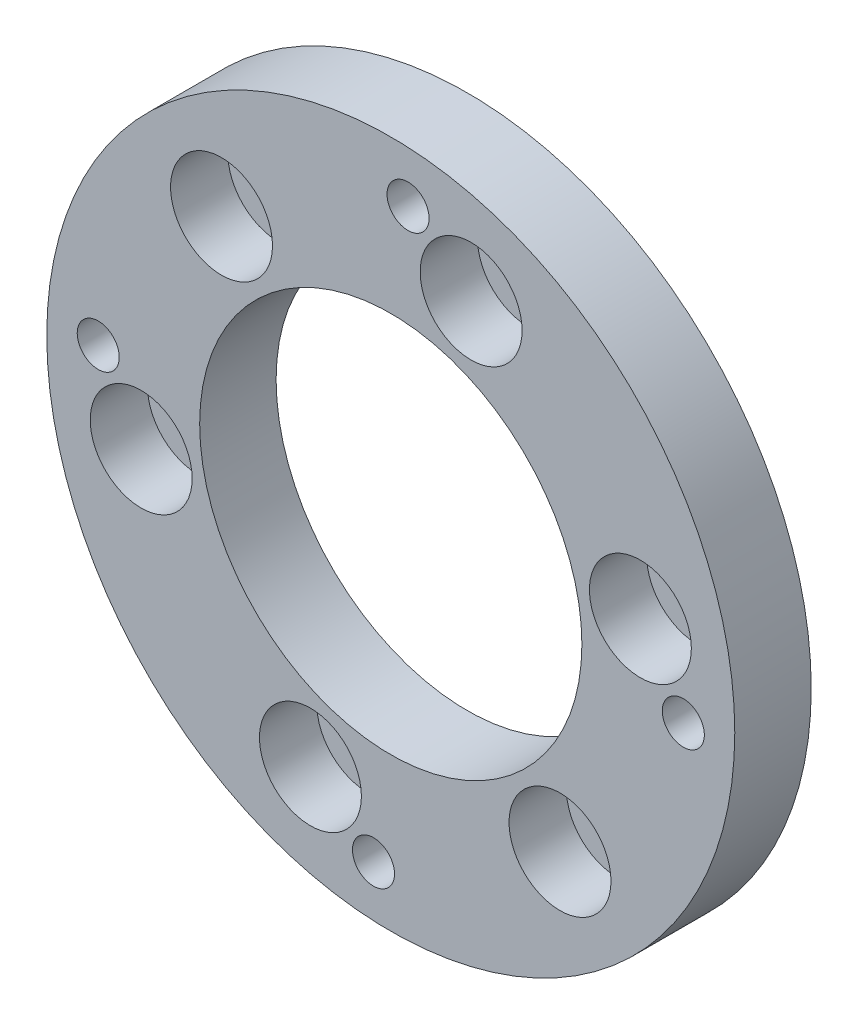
ISO-10303-21;
HEADER;
FILE_DESCRIPTION(('STEP AP214'),'2;1');
FILE_NAME('part.step','',(''),(''),'','','');
FILE_SCHEMA(('AUTOMOTIVE_DESIGN { 1 0 10303 214 1 1 1 1 }'));
ENDSEC;
DATA;
#1=APPLICATION_CONTEXT('core data for automotive mechanical design processes');
#2=APPLICATION_PROTOCOL_DEFINITION('international standard','automotive_design',2000,#1);
#3=PRODUCT_CONTEXT('',#1,'mechanical');
#4=PRODUCT('Part','Part','',(#3));
#5=PRODUCT_RELATED_PRODUCT_CATEGORY('part','',(#4));
#6=PRODUCT_DEFINITION_FORMATION('','',#4);
#7=PRODUCT_DEFINITION_CONTEXT('part definition',#1,'design');
#8=PRODUCT_DEFINITION('design','',#6,#7);
#9=PRODUCT_DEFINITION_SHAPE('','',#8);
#10=(LENGTH_UNIT() NAMED_UNIT(*) SI_UNIT(.MILLI.,.METRE.));
#11=(NAMED_UNIT(*) PLANE_ANGLE_UNIT() SI_UNIT($,.RADIAN.));
#12=(NAMED_UNIT(*) SI_UNIT($,.STERADIAN.) SOLID_ANGLE_UNIT());
#13=UNCERTAINTY_MEASURE_WITH_UNIT(LENGTH_MEASURE(1.E-05),#10,'distance_accuracy_value','');
#14=(GEOMETRIC_REPRESENTATION_CONTEXT(3) GLOBAL_UNCERTAINTY_ASSIGNED_CONTEXT((#13)) GLOBAL_UNIT_ASSIGNED_CONTEXT((#10,
#11,#12)) REPRESENTATION_CONTEXT('',''));
#15=CARTESIAN_POINT('',(0.,0.,0.));
#16=DIRECTION('',(0.,0.,1.));
#17=DIRECTION('',(1.,0.,0.));
#18=AXIS2_PLACEMENT_3D('',#15,#16,#17);
#19=CARTESIAN_POINT('',(0.,0.,0.));
#20=DIRECTION('',(0.,0.,1.));
#21=DIRECTION('',(1.,0.,0.));
#22=AXIS2_PLACEMENT_3D('',#19,#20,#21);
#23=PLANE('',#22);
#24=CARTESIAN_POINT('',(-19.5901046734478,-4.02837422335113,0.));
#25=DIRECTION('',(0.,0.,1.));
#26=DIRECTION('',(1.,0.,0.));
#27=AXIS2_PLACEMENT_3D('',#24,#25,#26);
#28=CIRCLE('',#27,2.25);
#29=CARTESIAN_POINT('',(-17.3401046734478,-4.02837422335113,0.));
#30=VERTEX_POINT('',#29);
#31=EDGE_CURVE('E140',#30,#30,#28,.T.);
#32=ORIENTED_EDGE('',*,*,#31,.T.);
#33=EDGE_LOOP('',(#32));
#34=FACE_BOUND('',#33,.T.);
#35=CARTESIAN_POINT('',(-6.30637792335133,-18.9797154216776,0.));
#36=DIRECTION('',(0.,0.,1.));
#37=DIRECTION('',(1.,0.,0.));
#38=AXIS2_PLACEMENT_3D('',#35,#36,#37);
#39=CIRCLE('',#38,2.25);
#40=CARTESIAN_POINT('',(-4.05637792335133,-18.9797154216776,0.));
#41=VERTEX_POINT('',#40);
#42=EDGE_CURVE('E128',#41,#41,#39,.T.);
#43=ORIENTED_EDGE('',*,*,#42,.T.);
#44=EDGE_LOOP('',(#43));
#45=FACE_BOUND('',#44,.T.);
#46=CARTESIAN_POINT('',(13.2837267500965,-14.9513411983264,0.));
#47=DIRECTION('',(0.,0.,1.));
#48=DIRECTION('',(1.,0.,0.));
#49=AXIS2_PLACEMENT_3D('',#46,#47,#48);
#50=CIRCLE('',#49,2.25);
#51=CARTESIAN_POINT('',(15.5337267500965,-14.9513411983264,0.));
#52=VERTEX_POINT('',#51);
#53=EDGE_CURVE('E116',#52,#52,#50,.T.);
#54=ORIENTED_EDGE('',*,*,#53,.T.);
#55=EDGE_LOOP('',(#54));
#56=FACE_BOUND('',#55,.T.);
#57=CARTESIAN_POINT('',(19.5901046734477,4.02837422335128,0.));
#58=DIRECTION('',(0.,0.,1.));
#59=DIRECTION('',(1.,0.,0.));
#60=AXIS2_PLACEMENT_3D('',#57,#58,#59);
#61=CIRCLE('',#60,2.25);
#62=CARTESIAN_POINT('',(21.8401046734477,4.02837422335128,0.));
#63=VERTEX_POINT('',#62);
#64=EDGE_CURVE('E104',#63,#63,#61,.T.);
#65=ORIENTED_EDGE('',*,*,#64,.T.);
#66=EDGE_LOOP('',(#65));
#67=FACE_BOUND('',#66,.T.);
#68=CARTESIAN_POINT('',(6.3063779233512,18.9797154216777,0.));
#69=DIRECTION('',(0.,0.,1.));
#70=DIRECTION('',(1.,0.,0.));
#71=AXIS2_PLACEMENT_3D('',#68,#69,#70);
#72=CIRCLE('',#71,2.25);
#73=CARTESIAN_POINT('',(8.5563779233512,18.9797154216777,0.));
#74=VERTEX_POINT('',#73);
#75=EDGE_CURVE('E92',#74,#74,#72,.T.);
#76=ORIENTED_EDGE('',*,*,#75,.T.);
#77=EDGE_LOOP('',(#76));
#78=FACE_BOUND('',#77,.T.);
#79=CARTESIAN_POINT('',(-13.2837267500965,14.9513411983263,0.));
#80=DIRECTION('',(0.,0.,1.));
#81=DIRECTION('',(1.,0.,0.));
#82=AXIS2_PLACEMENT_3D('',#79,#80,#81);
#83=CIRCLE('',#82,2.25);
#84=CARTESIAN_POINT('',(-11.0337267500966,14.9513411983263,0.));
#85=VERTEX_POINT('',#84);
#86=EDGE_CURVE('E80',#85,#85,#83,.T.);
#87=ORIENTED_EDGE('',*,*,#86,.T.);
#88=EDGE_LOOP('',(#87));
#89=FACE_BOUND('',#88,.T.);
#90=CARTESIAN_POINT('',(22.9599892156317,-1.35605870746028,0.));
#91=DIRECTION('',(0.,0.,-1.));
#92=DIRECTION('',(-1.,0.,0.));
#93=AXIS2_PLACEMENT_3D('',#90,#91,#92);
#94=CIRCLE('',#93,1.64999999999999);
#95=CARTESIAN_POINT('',(21.3099892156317,-1.35605870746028,0.));
#96=VERTEX_POINT('',#95);
#97=EDGE_CURVE('E62',#96,#96,#94,.T.);
#98=ORIENTED_EDGE('',*,*,#97,.F.);
#99=EDGE_LOOP('',(#98));
#100=FACE_BOUND('',#99,.T.);
#101=CARTESIAN_POINT('',(0.,0.,0.));
#102=DIRECTION('',(0.,0.,1.));
#103=DIRECTION('',(1.,0.,0.));
#104=AXIS2_PLACEMENT_3D('',#101,#102,#103);
#105=CIRCLE('',#104,15.);
#106=CARTESIAN_POINT('',(-15.,0.,0.));
#107=VERTEX_POINT('',#106);
#108=EDGE_CURVE('E42',#107,#107,#105,.T.);
#109=ORIENTED_EDGE('',*,*,#108,.T.);
#110=EDGE_LOOP('',(#109));
#111=FACE_BOUND('',#110,.T.);
#112=CARTESIAN_POINT('',(0.,0.,0.));
#113=DIRECTION('',(0.,0.,1.));
#114=DIRECTION('',(1.,0.,0.));
#115=AXIS2_PLACEMENT_3D('',#112,#113,#114);
#116=CIRCLE('',#115,27.);
#117=CARTESIAN_POINT('',(-27.,0.,0.));
#118=VERTEX_POINT('',#117);
#119=EDGE_CURVE('E34',#118,#118,#116,.T.);
#120=ORIENTED_EDGE('',*,*,#119,.F.);
#121=EDGE_LOOP('',(#120));
#122=FACE_BOUND('',#121,.T.);
#123=CARTESIAN_POINT('',(-22.9599892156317,1.35605870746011,0.));
#124=DIRECTION('',(0.,0.,-1.));
#125=DIRECTION('',(-1.,0.,0.));
#126=AXIS2_PLACEMENT_3D('',#123,#124,#125);
#127=CIRCLE('',#126,1.64999999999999);
#128=CARTESIAN_POINT('',(-24.6099892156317,1.35605870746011,0.));
#129=VERTEX_POINT('',#128);
#130=EDGE_CURVE('E50',#129,#129,#127,.T.);
#131=ORIENTED_EDGE('',*,*,#130,.F.);
#132=EDGE_LOOP('',(#131));
#133=FACE_BOUND('',#132,.T.);
#134=CARTESIAN_POINT('',(1.35605870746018,22.9599892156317,0.));
#135=DIRECTION('',(0.,0.,-1.));
#136=DIRECTION('',(-1.,0.,0.));
#137=AXIS2_PLACEMENT_3D('',#134,#135,#136);
#138=CIRCLE('',#137,1.64999999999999);
#139=CARTESIAN_POINT('',(-0.293941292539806,22.9599892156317,0.));
#140=VERTEX_POINT('',#139);
#141=EDGE_CURVE('E56',#140,#140,#138,.T.);
#142=ORIENTED_EDGE('',*,*,#141,.F.);
#143=EDGE_LOOP('',(#142));
#144=FACE_BOUND('',#143,.T.);
#145=CARTESIAN_POINT('',(-1.35605870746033,-22.9599892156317,0.));
#146=DIRECTION('',(0.,0.,-1.));
#147=DIRECTION('',(-1.,0.,0.));
#148=AXIS2_PLACEMENT_3D('',#145,#146,#147);
#149=CIRCLE('',#148,1.64999999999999);
#150=CARTESIAN_POINT('',(-3.00605870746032,-22.9599892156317,0.));
#151=VERTEX_POINT('',#150);
#152=EDGE_CURVE('E68',#151,#151,#149,.T.);
#153=ORIENTED_EDGE('',*,*,#152,.F.);
#154=EDGE_LOOP('',(#153));
#155=FACE_BOUND('',#154,.T.);
#156=ADVANCED_FACE('F27',(#34,#45,#56,#67,#78,#89,#100,#111,#122,#133,#144,#155),#23,.F.);
#157=CARTESIAN_POINT('',(0.,0.,6.));
#158=DIRECTION('',(0.,0.,1.));
#159=DIRECTION('',(1.,0.,0.));
#160=AXIS2_PLACEMENT_3D('',#157,#158,#159);
#161=PLANE('',#160);
#162=CARTESIAN_POINT('',(-19.5901046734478,-4.02837422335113,6.));
#163=DIRECTION('',(0.,0.,1.));
#164=DIRECTION('',(1.,0.,0.));
#165=AXIS2_PLACEMENT_3D('',#162,#163,#164);
#166=CIRCLE('',#165,4.);
#167=CARTESIAN_POINT('',(-15.5901046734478,-4.02837422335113,6.));
#168=VERTEX_POINT('',#167);
#169=EDGE_CURVE('E131',#168,#168,#166,.T.);
#170=ORIENTED_EDGE('',*,*,#169,.F.);
#171=EDGE_LOOP('',(#170));
#172=FACE_BOUND('',#171,.T.);
#173=CARTESIAN_POINT('',(-6.30637792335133,-18.9797154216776,5.99999999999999));
#174=DIRECTION('',(0.,0.,1.));
#175=DIRECTION('',(1.,0.,0.));
#176=AXIS2_PLACEMENT_3D('',#173,#174,#175);
#177=CIRCLE('',#176,4.);
#178=CARTESIAN_POINT('',(-2.30637792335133,-18.9797154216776,5.99999999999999));
#179=VERTEX_POINT('',#178);
#180=EDGE_CURVE('E119',#179,#179,#177,.T.);
#181=ORIENTED_EDGE('',*,*,#180,.F.);
#182=EDGE_LOOP('',(#181));
#183=FACE_BOUND('',#182,.T.);
#184=CARTESIAN_POINT('',(13.2837267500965,-14.9513411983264,5.99999999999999));
#185=DIRECTION('',(0.,0.,1.));
#186=DIRECTION('',(1.,0.,0.));
#187=AXIS2_PLACEMENT_3D('',#184,#185,#186);
#188=CIRCLE('',#187,4.);
#189=CARTESIAN_POINT('',(17.2837267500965,-14.9513411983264,5.99999999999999));
#190=VERTEX_POINT('',#189);
#191=EDGE_CURVE('E107',#190,#190,#188,.T.);
#192=ORIENTED_EDGE('',*,*,#191,.F.);
#193=EDGE_LOOP('',(#192));
#194=FACE_BOUND('',#193,.T.);
#195=CARTESIAN_POINT('',(19.5901046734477,4.02837422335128,6.));
#196=DIRECTION('',(0.,0.,1.));
#197=DIRECTION('',(1.,0.,0.));
#198=AXIS2_PLACEMENT_3D('',#195,#196,#197);
#199=CIRCLE('',#198,4.);
#200=CARTESIAN_POINT('',(23.5901046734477,4.02837422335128,6.));
#201=VERTEX_POINT('',#200);
#202=EDGE_CURVE('E95',#201,#201,#199,.T.);
#203=ORIENTED_EDGE('',*,*,#202,.F.);
#204=EDGE_LOOP('',(#203));
#205=FACE_BOUND('',#204,.T.);
#206=CARTESIAN_POINT('',(6.3063779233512,18.9797154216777,6.00000000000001));
#207=DIRECTION('',(0.,0.,1.));
#208=DIRECTION('',(1.,0.,0.));
#209=AXIS2_PLACEMENT_3D('',#206,#207,#208);
#210=CIRCLE('',#209,4.);
#211=CARTESIAN_POINT('',(10.3063779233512,18.9797154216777,6.00000000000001));
#212=VERTEX_POINT('',#211);
#213=EDGE_CURVE('E83',#212,#212,#210,.T.);
#214=ORIENTED_EDGE('',*,*,#213,.F.);
#215=EDGE_LOOP('',(#214));
#216=FACE_BOUND('',#215,.T.);
#217=CARTESIAN_POINT('',(-13.2837267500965,14.9513411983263,6.00000000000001));
#218=DIRECTION('',(0.,0.,1.));
#219=DIRECTION('',(1.,0.,0.));
#220=AXIS2_PLACEMENT_3D('',#217,#218,#219);
#221=CIRCLE('',#220,4.);
#222=CARTESIAN_POINT('',(-9.28372675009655,14.9513411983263,6.00000000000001));
#223=VERTEX_POINT('',#222);
#224=EDGE_CURVE('E71',#223,#223,#221,.T.);
#225=ORIENTED_EDGE('',*,*,#224,.F.);
#226=EDGE_LOOP('',(#225));
#227=FACE_BOUND('',#226,.T.);
#228=CARTESIAN_POINT('',(22.9599892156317,-1.35605870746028,6.00000000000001));
#229=DIRECTION('',(0.,0.,-1.));
#230=DIRECTION('',(-1.,0.,0.));
#231=AXIS2_PLACEMENT_3D('',#228,#229,#230);
#232=CIRCLE('',#231,1.64999999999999);
#233=CARTESIAN_POINT('',(21.3099892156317,-1.35605870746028,6.00000000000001));
#234=VERTEX_POINT('',#233);
#235=EDGE_CURVE('E59',#234,#234,#232,.T.);
#236=ORIENTED_EDGE('',*,*,#235,.T.);
#237=EDGE_LOOP('',(#236));
#238=FACE_BOUND('',#237,.T.);
#239=CARTESIAN_POINT('',(1.35605870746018,22.9599892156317,6.00000000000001));
#240=DIRECTION('',(0.,0.,-1.));
#241=DIRECTION('',(-1.,0.,0.));
#242=AXIS2_PLACEMENT_3D('',#239,#240,#241);
#243=CIRCLE('',#242,1.64999999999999);
#244=CARTESIAN_POINT('',(-0.293941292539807,22.9599892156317,6.00000000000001));
#245=VERTEX_POINT('',#244);
#246=EDGE_CURVE('E53',#245,#245,#243,.T.);
#247=ORIENTED_EDGE('',*,*,#246,.T.);
#248=EDGE_LOOP('',(#247));
#249=FACE_BOUND('',#248,.T.);
#250=CARTESIAN_POINT('',(-22.9599892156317,1.35605870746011,6.00000000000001));
#251=DIRECTION('',(0.,0.,-1.));
#252=DIRECTION('',(-1.,0.,0.));
#253=AXIS2_PLACEMENT_3D('',#250,#251,#252);
#254=CIRCLE('',#253,1.64999999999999);
#255=CARTESIAN_POINT('',(-24.6099892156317,1.35605870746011,6.00000000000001));
#256=VERTEX_POINT('',#255);
#257=EDGE_CURVE('E47',#256,#256,#254,.T.);
#258=ORIENTED_EDGE('',*,*,#257,.T.);
#259=EDGE_LOOP('',(#258));
#260=FACE_BOUND('',#259,.T.);
#261=CARTESIAN_POINT('',(0.,0.,6.));
#262=DIRECTION('',(0.,0.,1.));
#263=DIRECTION('',(1.,0.,0.));
#264=AXIS2_PLACEMENT_3D('',#261,#262,#263);
#265=CIRCLE('',#264,27.);
#266=CARTESIAN_POINT('',(-27.,0.,6.));
#267=VERTEX_POINT('',#266);
#268=EDGE_CURVE('E10',#267,#267,#265,.T.);
#269=ORIENTED_EDGE('',*,*,#268,.T.);
#270=EDGE_LOOP('',(#269));
#271=FACE_BOUND('',#270,.T.);
#272=CARTESIAN_POINT('',(0.,0.,6.));
#273=DIRECTION('',(0.,0.,1.));
#274=DIRECTION('',(1.,0.,0.));
#275=AXIS2_PLACEMENT_3D('',#272,#273,#274);
#276=CIRCLE('',#275,15.);
#277=CARTESIAN_POINT('',(-15.,0.,6.));
#278=VERTEX_POINT('',#277);
#279=EDGE_CURVE('E38',#278,#278,#276,.T.);
#280=ORIENTED_EDGE('',*,*,#279,.F.);
#281=EDGE_LOOP('',(#280));
#282=FACE_BOUND('',#281,.T.);
#283=CARTESIAN_POINT('',(-1.35605870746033,-22.9599892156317,5.99999999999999));
#284=DIRECTION('',(0.,0.,-1.));
#285=DIRECTION('',(-1.,0.,0.));
#286=AXIS2_PLACEMENT_3D('',#283,#284,#285);
#287=CIRCLE('',#286,1.64999999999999);
#288=CARTESIAN_POINT('',(-3.00605870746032,-22.9599892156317,5.99999999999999));
#289=VERTEX_POINT('',#288);
#290=EDGE_CURVE('E65',#289,#289,#287,.T.);
#291=ORIENTED_EDGE('',*,*,#290,.T.);
#292=EDGE_LOOP('',(#291));
#293=FACE_BOUND('',#292,.T.);
#294=ADVANCED_FACE('F165',(#172,#183,#194,#205,#216,#227,#238,#249,#260,#271,#282,#293),#161,.T.);
#295=CARTESIAN_POINT('',(0.,0.,6.));
#296=DIRECTION('',(0.,0.,-1.));
#297=DIRECTION('',(-1.,0.,0.));
#298=AXIS2_PLACEMENT_3D('',#295,#296,#297);
#299=CYLINDRICAL_SURFACE('',#298,27.);
#300=CARTESIAN_POINT('',(-27.,0.,6.));
#301=CARTESIAN_POINT('',(-27.,0.,5.9375));
#302=CARTESIAN_POINT('',(-27.,0.,5.875));
#303=CARTESIAN_POINT('',(-27.,0.,5.75));
#304=CARTESIAN_POINT('',(-27.,0.,5.6875));
#305=CARTESIAN_POINT('',(-27.,0.,5.5625));
#306=CARTESIAN_POINT('',(-27.,0.,5.5));
#307=CARTESIAN_POINT('',(-27.,0.,5.375));
#308=CARTESIAN_POINT('',(-27.,0.,5.3125));
#309=CARTESIAN_POINT('',(-27.,0.,5.1875));
#310=CARTESIAN_POINT('',(-27.,0.,5.125));
#311=CARTESIAN_POINT('',(-27.,0.,5.));
#312=CARTESIAN_POINT('',(-27.,0.,4.9375));
#313=CARTESIAN_POINT('',(-27.,0.,4.8125));
#314=CARTESIAN_POINT('',(-27.,0.,4.75));
#315=CARTESIAN_POINT('',(-27.,0.,4.625));
#316=CARTESIAN_POINT('',(-27.,0.,4.5625));
#317=CARTESIAN_POINT('',(-27.,0.,4.4375));
#318=CARTESIAN_POINT('',(-27.,0.,4.375));
#319=CARTESIAN_POINT('',(-27.,0.,4.25));
#320=CARTESIAN_POINT('',(-27.,0.,4.1875));
#321=CARTESIAN_POINT('',(-27.,0.,4.0625));
#322=CARTESIAN_POINT('',(-27.,0.,4.));
#323=CARTESIAN_POINT('',(-27.,0.,3.875));
#324=CARTESIAN_POINT('',(-27.,0.,3.8125));
#325=CARTESIAN_POINT('',(-27.,0.,3.6875));
#326=CARTESIAN_POINT('',(-27.,0.,3.625));
#327=CARTESIAN_POINT('',(-27.,0.,3.5));
#328=CARTESIAN_POINT('',(-27.,0.,3.4375));
#329=CARTESIAN_POINT('',(-27.,0.,3.3125));
#330=CARTESIAN_POINT('',(-27.,0.,3.25));
#331=CARTESIAN_POINT('',(-27.,0.,3.125));
#332=CARTESIAN_POINT('',(-27.,0.,3.0625));
#333=CARTESIAN_POINT('',(-27.,0.,2.9375));
#334=CARTESIAN_POINT('',(-27.,0.,2.875));
#335=CARTESIAN_POINT('',(-27.,0.,2.75));
#336=CARTESIAN_POINT('',(-27.,0.,2.6875));
#337=CARTESIAN_POINT('',(-27.,0.,2.5625));
#338=CARTESIAN_POINT('',(-27.,0.,2.5));
#339=CARTESIAN_POINT('',(-27.,0.,2.375));
#340=CARTESIAN_POINT('',(-27.,0.,2.3125));
#341=CARTESIAN_POINT('',(-27.,0.,2.1875));
#342=CARTESIAN_POINT('',(-27.,0.,2.125));
#343=CARTESIAN_POINT('',(-27.,0.,2.));
#344=CARTESIAN_POINT('',(-27.,0.,1.9375));
#345=CARTESIAN_POINT('',(-27.,0.,1.8125));
#346=CARTESIAN_POINT('',(-27.,0.,1.75));
#347=CARTESIAN_POINT('',(-27.,0.,1.625));
#348=CARTESIAN_POINT('',(-27.,0.,1.5625));
#349=CARTESIAN_POINT('',(-27.,0.,1.4375));
#350=CARTESIAN_POINT('',(-27.,0.,1.375));
#351=CARTESIAN_POINT('',(-27.,0.,1.25));
#352=CARTESIAN_POINT('',(-27.,0.,1.1875));
#353=CARTESIAN_POINT('',(-27.,0.,1.0625));
#354=CARTESIAN_POINT('',(-27.,0.,0.999999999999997));
#355=CARTESIAN_POINT('',(-27.,0.,0.874999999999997));
#356=CARTESIAN_POINT('',(-27.,0.,0.812499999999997));
#357=CARTESIAN_POINT('',(-27.,0.,0.687499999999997));
#358=CARTESIAN_POINT('',(-27.,0.,0.624999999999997));
#359=CARTESIAN_POINT('',(-27.,0.,0.499999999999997));
#360=CARTESIAN_POINT('',(-27.,0.,0.437499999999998));
#361=CARTESIAN_POINT('',(-27.,0.,0.312499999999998));
#362=CARTESIAN_POINT('',(-27.,0.,0.249999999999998));
#363=CARTESIAN_POINT('',(-27.,0.,0.124999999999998));
#364=CARTESIAN_POINT('',(-27.,0.,0.062499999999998));
#365=CARTESIAN_POINT('',(-27.,0.,0.));
#366=B_SPLINE_CURVE_WITH_KNOTS('',3,(#300,#301,#302,#303,#304,#305,#306,#307,#308,#309,#310,
#311,#312,#313,#314,#315,#316,#317,#318,#319,#320,#321,#322,#323,#324,#325,#326,#327,#328,#329,
#330,#331,#332,#333,#334,#335,#336,#337,#338,#339,#340,#341,#342,#343,#344,#345,#346,#347,#348,
#349,#350,#351,#352,#353,#354,#355,#356,#357,#358,#359,#360,#361,#362,#363,#364,#365),
.UNSPECIFIED.,.F.,.F.,(4,2,2,2,2,2,2,2,2,2,2,2,2,2,2,2,2,2,2,2,2,2,2,2,2,2,2,2,2,2,2,2,4),(0.,
0.187499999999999,0.374999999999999,0.5625,0.749999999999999,0.937499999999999,1.125,1.3125,1.5,
1.6875,1.875,2.0625,2.25,2.4375,2.625,2.8125,3.,3.1875,3.375,3.5625,3.75,3.9375,4.125,4.3125,
4.5,4.6875,4.875,5.0625,5.25,5.4375,5.625,5.8125,6.),.UNSPECIFIED.);
#367=EDGE_CURVE('BSEAM29',#267,#118,#366,.T.);
#368=ORIENTED_EDGE('',*,*,#268,.F.);
#369=ORIENTED_EDGE('',*,*,#119,.T.);
#370=ORIENTED_EDGE('',*,*,#367,.T.);
#371=ORIENTED_EDGE('',*,*,#367,.F.);
#372=EDGE_LOOP('',(#368,#370,#369,#371));
#373=FACE_BOUND('',#372,.T.);
#374=ADVANCED_FACE('F29',(#373),#299,.T.);
#375=CARTESIAN_POINT('',(0.,0.,6.));
#376=DIRECTION('',(0.,0.,-1.));
#377=DIRECTION('',(-1.,0.,0.));
#378=AXIS2_PLACEMENT_3D('',#375,#376,#377);
#379=CYLINDRICAL_SURFACE('',#378,15.);
#380=CARTESIAN_POINT('',(-15.,0.,6.));
#381=CARTESIAN_POINT('',(-15.,0.,5.9375));
#382=CARTESIAN_POINT('',(-15.,0.,5.875));
#383=CARTESIAN_POINT('',(-15.,0.,5.75));
#384=CARTESIAN_POINT('',(-15.,0.,5.6875));
#385=CARTESIAN_POINT('',(-15.,0.,5.5625));
#386=CARTESIAN_POINT('',(-15.,0.,5.5));
#387=CARTESIAN_POINT('',(-15.,0.,5.375));
#388=CARTESIAN_POINT('',(-15.,0.,5.3125));
#389=CARTESIAN_POINT('',(-15.,0.,5.1875));
#390=CARTESIAN_POINT('',(-15.,0.,5.125));
#391=CARTESIAN_POINT('',(-15.,0.,5.));
#392=CARTESIAN_POINT('',(-15.,0.,4.9375));
#393=CARTESIAN_POINT('',(-15.,0.,4.8125));
#394=CARTESIAN_POINT('',(-15.,0.,4.75));
#395=CARTESIAN_POINT('',(-15.,0.,4.625));
#396=CARTESIAN_POINT('',(-15.,0.,4.5625));
#397=CARTESIAN_POINT('',(-15.,0.,4.4375));
#398=CARTESIAN_POINT('',(-15.,0.,4.375));
#399=CARTESIAN_POINT('',(-15.,0.,4.25));
#400=CARTESIAN_POINT('',(-15.,0.,4.1875));
#401=CARTESIAN_POINT('',(-15.,0.,4.0625));
#402=CARTESIAN_POINT('',(-15.,0.,4.));
#403=CARTESIAN_POINT('',(-15.,0.,3.875));
#404=CARTESIAN_POINT('',(-15.,0.,3.8125));
#405=CARTESIAN_POINT('',(-15.,0.,3.6875));
#406=CARTESIAN_POINT('',(-15.,0.,3.625));
#407=CARTESIAN_POINT('',(-15.,0.,3.5));
#408=CARTESIAN_POINT('',(-15.,0.,3.4375));
#409=CARTESIAN_POINT('',(-15.,0.,3.3125));
#410=CARTESIAN_POINT('',(-15.,0.,3.25));
#411=CARTESIAN_POINT('',(-15.,0.,3.125));
#412=CARTESIAN_POINT('',(-15.,0.,3.0625));
#413=CARTESIAN_POINT('',(-15.,0.,2.9375));
#414=CARTESIAN_POINT('',(-15.,0.,2.875));
#415=CARTESIAN_POINT('',(-15.,0.,2.75));
#416=CARTESIAN_POINT('',(-15.,0.,2.6875));
#417=CARTESIAN_POINT('',(-15.,0.,2.5625));
#418=CARTESIAN_POINT('',(-15.,0.,2.5));
#419=CARTESIAN_POINT('',(-15.,0.,2.375));
#420=CARTESIAN_POINT('',(-15.,0.,2.3125));
#421=CARTESIAN_POINT('',(-15.,0.,2.1875));
#422=CARTESIAN_POINT('',(-15.,0.,2.125));
#423=CARTESIAN_POINT('',(-15.,0.,2.));
#424=CARTESIAN_POINT('',(-15.,0.,1.9375));
#425=CARTESIAN_POINT('',(-15.,0.,1.8125));
#426=CARTESIAN_POINT('',(-15.,0.,1.75));
#427=CARTESIAN_POINT('',(-15.,0.,1.625));
#428=CARTESIAN_POINT('',(-15.,0.,1.5625));
#429=CARTESIAN_POINT('',(-15.,0.,1.4375));
#430=CARTESIAN_POINT('',(-15.,0.,1.375));
#431=CARTESIAN_POINT('',(-15.,0.,1.25));
#432=CARTESIAN_POINT('',(-15.,0.,1.1875));
#433=CARTESIAN_POINT('',(-15.,0.,1.0625));
#434=CARTESIAN_POINT('',(-15.,0.,0.999999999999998));
#435=CARTESIAN_POINT('',(-15.,0.,0.874999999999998));
#436=CARTESIAN_POINT('',(-15.,0.,0.812499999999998));
#437=CARTESIAN_POINT('',(-15.,0.,0.687499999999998));
#438=CARTESIAN_POINT('',(-15.,0.,0.624999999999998));
#439=CARTESIAN_POINT('',(-15.,0.,0.499999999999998));
#440=CARTESIAN_POINT('',(-15.,0.,0.437499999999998));
#441=CARTESIAN_POINT('',(-15.,0.,0.312499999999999));
#442=CARTESIAN_POINT('',(-15.,0.,0.249999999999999));
#443=CARTESIAN_POINT('',(-15.,0.,0.124999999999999));
#444=CARTESIAN_POINT('',(-15.,0.,0.0624999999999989));
#445=CARTESIAN_POINT('',(-15.,0.,0.));
#446=B_SPLINE_CURVE_WITH_KNOTS('',3,(#380,#381,#382,#383,#384,#385,#386,#387,#388,#389,#390,
#391,#392,#393,#394,#395,#396,#397,#398,#399,#400,#401,#402,#403,#404,#405,#406,#407,#408,#409,
#410,#411,#412,#413,#414,#415,#416,#417,#418,#419,#420,#421,#422,#423,#424,#425,#426,#427,#428,
#429,#430,#431,#432,#433,#434,#435,#436,#437,#438,#439,#440,#441,#442,#443,#444,#445),
.UNSPECIFIED.,.F.,.F.,(4,2,2,2,2,2,2,2,2,2,2,2,2,2,2,2,2,2,2,2,2,2,2,2,2,2,2,2,2,2,2,2,4),(0.,
0.187499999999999,0.374999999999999,0.5625,0.749999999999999,0.937499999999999,1.125,1.3125,1.5,
1.6875,1.875,2.0625,2.25,2.4375,2.625,2.8125,3.,3.1875,3.375,3.5625,3.75,3.9375,4.125,4.3125,
4.5,4.6875,4.875,5.0625,5.25,5.4375,5.625,5.8125,6.),.UNSPECIFIED.);
#447=EDGE_CURVE('BSEAM201',#278,#107,#446,.T.);
#448=ORIENTED_EDGE('',*,*,#279,.T.);
#449=ORIENTED_EDGE('',*,*,#108,.F.);
#450=ORIENTED_EDGE('',*,*,#447,.T.);
#451=ORIENTED_EDGE('',*,*,#447,.F.);
#452=EDGE_LOOP('',(#448,#450,#449,#451));
#453=FACE_BOUND('',#452,.T.);
#454=ADVANCED_FACE('F201',(#453),#379,.F.);
#455=CARTESIAN_POINT('',(-22.9599892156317,1.35605870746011,0.));
#456=DIRECTION('',(0.,0.,-1.));
#457=DIRECTION('',(-1.,0.,0.));
#458=AXIS2_PLACEMENT_3D('',#455,#456,#457);
#459=CYLINDRICAL_SURFACE('',#458,1.64999999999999);
#460=CARTESIAN_POINT('',(-24.6099892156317,1.35605870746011,6.00000000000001));
#461=CARTESIAN_POINT('',(-24.6099892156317,1.35605870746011,5.93750000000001));
#462=CARTESIAN_POINT('',(-24.6099892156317,1.35605870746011,5.87500000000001));
#463=CARTESIAN_POINT('',(-24.6099892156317,1.35605870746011,5.75000000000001));
#464=CARTESIAN_POINT('',(-24.6099892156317,1.35605870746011,5.68750000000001));
#465=CARTESIAN_POINT('',(-24.6099892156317,1.35605870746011,5.56250000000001));
#466=CARTESIAN_POINT('',(-24.6099892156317,1.35605870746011,5.50000000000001));
#467=CARTESIAN_POINT('',(-24.6099892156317,1.35605870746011,5.37500000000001));
#468=CARTESIAN_POINT('',(-24.6099892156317,1.35605870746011,5.31250000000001));
#469=CARTESIAN_POINT('',(-24.6099892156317,1.35605870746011,5.18750000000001));
#470=CARTESIAN_POINT('',(-24.6099892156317,1.35605870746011,5.12500000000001));
#471=CARTESIAN_POINT('',(-24.6099892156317,1.35605870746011,5.00000000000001));
#472=CARTESIAN_POINT('',(-24.6099892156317,1.35605870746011,4.93750000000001));
#473=CARTESIAN_POINT('',(-24.6099892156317,1.35605870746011,4.81250000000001));
#474=CARTESIAN_POINT('',(-24.6099892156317,1.35605870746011,4.75000000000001));
#475=CARTESIAN_POINT('',(-24.6099892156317,1.35605870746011,4.62500000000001));
#476=CARTESIAN_POINT('',(-24.6099892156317,1.35605870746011,4.56250000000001));
#477=CARTESIAN_POINT('',(-24.6099892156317,1.35605870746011,4.4375));
#478=CARTESIAN_POINT('',(-24.6099892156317,1.35605870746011,4.375));
#479=CARTESIAN_POINT('',(-24.6099892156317,1.35605870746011,4.25));
#480=CARTESIAN_POINT('',(-24.6099892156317,1.35605870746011,4.1875));
#481=CARTESIAN_POINT('',(-24.6099892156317,1.35605870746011,4.0625));
#482=CARTESIAN_POINT('',(-24.6099892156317,1.35605870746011,4.));
#483=CARTESIAN_POINT('',(-24.6099892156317,1.35605870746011,3.875));
#484=CARTESIAN_POINT('',(-24.6099892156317,1.35605870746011,3.8125));
#485=CARTESIAN_POINT('',(-24.6099892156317,1.35605870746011,3.6875));
#486=CARTESIAN_POINT('',(-24.6099892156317,1.35605870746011,3.625));
#487=CARTESIAN_POINT('',(-24.6099892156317,1.35605870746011,3.5));
#488=CARTESIAN_POINT('',(-24.6099892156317,1.35605870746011,3.4375));
#489=CARTESIAN_POINT('',(-24.6099892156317,1.35605870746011,3.3125));
#490=CARTESIAN_POINT('',(-24.6099892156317,1.35605870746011,3.25));
#491=CARTESIAN_POINT('',(-24.6099892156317,1.35605870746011,3.125));
#492=CARTESIAN_POINT('',(-24.6099892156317,1.35605870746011,3.0625));
#493=CARTESIAN_POINT('',(-24.6099892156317,1.35605870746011,2.9375));
#494=CARTESIAN_POINT('',(-24.6099892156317,1.35605870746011,2.875));
#495=CARTESIAN_POINT('',(-24.6099892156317,1.35605870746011,2.75));
#496=CARTESIAN_POINT('',(-24.6099892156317,1.35605870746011,2.6875));
#497=CARTESIAN_POINT('',(-24.6099892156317,1.35605870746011,2.5625));
#498=CARTESIAN_POINT('',(-24.6099892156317,1.35605870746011,2.5));
#499=CARTESIAN_POINT('',(-24.6099892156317,1.35605870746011,2.375));
#500=CARTESIAN_POINT('',(-24.6099892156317,1.35605870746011,2.3125));
#501=CARTESIAN_POINT('',(-24.6099892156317,1.35605870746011,2.1875));
#502=CARTESIAN_POINT('',(-24.6099892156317,1.35605870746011,2.125));
#503=CARTESIAN_POINT('',(-24.6099892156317,1.35605870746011,2.));
#504=CARTESIAN_POINT('',(-24.6099892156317,1.35605870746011,1.9375));
#505=CARTESIAN_POINT('',(-24.6099892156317,1.35605870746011,1.8125));
#506=CARTESIAN_POINT('',(-24.6099892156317,1.35605870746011,1.75));
#507=CARTESIAN_POINT('',(-24.6099892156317,1.35605870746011,1.625));
#508=CARTESIAN_POINT('',(-24.6099892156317,1.35605870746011,1.5625));
#509=CARTESIAN_POINT('',(-24.6099892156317,1.35605870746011,1.4375));
#510=CARTESIAN_POINT('',(-24.6099892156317,1.35605870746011,1.375));
#511=CARTESIAN_POINT('',(-24.6099892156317,1.35605870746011,1.25));
#512=CARTESIAN_POINT('',(-24.6099892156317,1.35605870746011,1.1875));
#513=CARTESIAN_POINT('',(-24.6099892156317,1.35605870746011,1.0625));
#514=CARTESIAN_POINT('',(-24.6099892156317,1.35605870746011,1.));
#515=CARTESIAN_POINT('',(-24.6099892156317,1.35605870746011,0.875000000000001));
#516=CARTESIAN_POINT('',(-24.6099892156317,1.35605870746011,0.812500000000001));
#517=CARTESIAN_POINT('',(-24.6099892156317,1.35605870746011,0.687500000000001));
#518=CARTESIAN_POINT('',(-24.6099892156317,1.35605870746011,0.625000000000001));
#519=CARTESIAN_POINT('',(-24.6099892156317,1.35605870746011,0.5));
#520=CARTESIAN_POINT('',(-24.6099892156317,1.35605870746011,0.4375));
#521=CARTESIAN_POINT('',(-24.6099892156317,1.35605870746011,0.3125));
#522=CARTESIAN_POINT('',(-24.6099892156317,1.35605870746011,0.25));
#523=CARTESIAN_POINT('',(-24.6099892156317,1.35605870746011,0.125));
#524=CARTESIAN_POINT('',(-24.6099892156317,1.35605870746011,0.0625000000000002));
#525=CARTESIAN_POINT('',(-24.6099892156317,1.35605870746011,0.));
#526=B_SPLINE_CURVE_WITH_KNOTS('',3,(#460,#461,#462,#463,#464,#465,#466,#467,#468,#469,#470,
#471,#472,#473,#474,#475,#476,#477,#478,#479,#480,#481,#482,#483,#484,#485,#486,#487,#488,#489,
#490,#491,#492,#493,#494,#495,#496,#497,#498,#499,#500,#501,#502,#503,#504,#505,#506,#507,#508,
#509,#510,#511,#512,#513,#514,#515,#516,#517,#518,#519,#520,#521,#522,#523,#524,#525),
.UNSPECIFIED.,.F.,.F.,(4,2,2,2,2,2,2,2,2,2,2,2,2,2,2,2,2,2,2,2,2,2,2,2,2,2,2,2,2,2,2,2,4),(0.,
0.187499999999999,0.374999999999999,0.5625,0.75,0.9375,1.125,1.3125,1.5,1.6875,1.875,2.0625,
2.25,2.4375,2.625,2.8125,3.,3.1875,3.375,3.5625,3.75,3.9375,4.125,4.3125,4.5,4.68750000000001,
4.87500000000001,5.06250000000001,5.25000000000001,5.43750000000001,5.62500000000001,
5.81250000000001,6.00000000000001),.UNSPECIFIED.);
#527=EDGE_CURVE('BSEAM204',#256,#129,#526,.T.);
#528=ORIENTED_EDGE('',*,*,#257,.F.);
#529=ORIENTED_EDGE('',*,*,#130,.T.);
#530=ORIENTED_EDGE('',*,*,#527,.T.);
#531=ORIENTED_EDGE('',*,*,#527,.F.);
#532=EDGE_LOOP('',(#528,#530,#529,#531));
#533=FACE_BOUND('',#532,.T.);
#534=ADVANCED_FACE('F204',(#533),#459,.F.);
#535=CARTESIAN_POINT('',(1.35605870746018,22.9599892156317,0.));
#536=DIRECTION('',(0.,0.,-1.));
#537=DIRECTION('',(-1.,0.,0.));
#538=AXIS2_PLACEMENT_3D('',#535,#536,#537);
#539=CYLINDRICAL_SURFACE('',#538,1.64999999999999);
#540=CARTESIAN_POINT('',(-0.293941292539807,22.9599892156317,6.00000000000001));
#541=CARTESIAN_POINT('',(-0.293941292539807,22.9599892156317,5.93750000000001));
#542=CARTESIAN_POINT('',(-0.293941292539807,22.9599892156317,5.87500000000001));
#543=CARTESIAN_POINT('',(-0.293941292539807,22.9599892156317,5.75000000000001));
#544=CARTESIAN_POINT('',(-0.293941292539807,22.9599892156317,5.68750000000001));
#545=CARTESIAN_POINT('',(-0.293941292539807,22.9599892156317,5.56250000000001));
#546=CARTESIAN_POINT('',(-0.293941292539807,22.9599892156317,5.50000000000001));
#547=CARTESIAN_POINT('',(-0.293941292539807,22.9599892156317,5.37500000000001));
#548=CARTESIAN_POINT('',(-0.293941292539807,22.9599892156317,5.31250000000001));
#549=CARTESIAN_POINT('',(-0.293941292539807,22.9599892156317,5.18750000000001));
#550=CARTESIAN_POINT('',(-0.293941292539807,22.9599892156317,5.12500000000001));
#551=CARTESIAN_POINT('',(-0.293941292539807,22.9599892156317,5.00000000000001));
#552=CARTESIAN_POINT('',(-0.293941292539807,22.9599892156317,4.93750000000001));
#553=CARTESIAN_POINT('',(-0.293941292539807,22.9599892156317,4.81250000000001));
#554=CARTESIAN_POINT('',(-0.293941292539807,22.9599892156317,4.75000000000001));
#555=CARTESIAN_POINT('',(-0.293941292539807,22.9599892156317,4.62500000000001));
#556=CARTESIAN_POINT('',(-0.293941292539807,22.9599892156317,4.56250000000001));
#557=CARTESIAN_POINT('',(-0.293941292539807,22.9599892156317,4.4375));
#558=CARTESIAN_POINT('',(-0.293941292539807,22.9599892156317,4.375));
#559=CARTESIAN_POINT('',(-0.293941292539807,22.9599892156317,4.25));
#560=CARTESIAN_POINT('',(-0.293941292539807,22.9599892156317,4.1875));
#561=CARTESIAN_POINT('',(-0.293941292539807,22.9599892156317,4.0625));
#562=CARTESIAN_POINT('',(-0.293941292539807,22.9599892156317,4.));
#563=CARTESIAN_POINT('',(-0.293941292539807,22.9599892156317,3.875));
#564=CARTESIAN_POINT('',(-0.293941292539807,22.9599892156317,3.8125));
#565=CARTESIAN_POINT('',(-0.293941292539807,22.9599892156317,3.6875));
#566=CARTESIAN_POINT('',(-0.293941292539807,22.9599892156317,3.625));
#567=CARTESIAN_POINT('',(-0.293941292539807,22.9599892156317,3.5));
#568=CARTESIAN_POINT('',(-0.293941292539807,22.9599892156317,3.4375));
#569=CARTESIAN_POINT('',(-0.293941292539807,22.9599892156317,3.3125));
#570=CARTESIAN_POINT('',(-0.293941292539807,22.9599892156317,3.25));
#571=CARTESIAN_POINT('',(-0.293941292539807,22.9599892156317,3.125));
#572=CARTESIAN_POINT('',(-0.293941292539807,22.9599892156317,3.0625));
#573=CARTESIAN_POINT('',(-0.293941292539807,22.9599892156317,2.9375));
#574=CARTESIAN_POINT('',(-0.293941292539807,22.9599892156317,2.875));
#575=CARTESIAN_POINT('',(-0.293941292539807,22.9599892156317,2.75));
#576=CARTESIAN_POINT('',(-0.293941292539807,22.9599892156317,2.6875));
#577=CARTESIAN_POINT('',(-0.293941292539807,22.9599892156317,2.5625));
#578=CARTESIAN_POINT('',(-0.293941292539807,22.9599892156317,2.5));
#579=CARTESIAN_POINT('',(-0.293941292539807,22.9599892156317,2.375));
#580=CARTESIAN_POINT('',(-0.293941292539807,22.9599892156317,2.3125));
#581=CARTESIAN_POINT('',(-0.293941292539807,22.9599892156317,2.1875));
#582=CARTESIAN_POINT('',(-0.293941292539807,22.9599892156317,2.125));
#583=CARTESIAN_POINT('',(-0.293941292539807,22.9599892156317,2.));
#584=CARTESIAN_POINT('',(-0.293941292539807,22.9599892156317,1.9375));
#585=CARTESIAN_POINT('',(-0.293941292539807,22.9599892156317,1.8125));
#586=CARTESIAN_POINT('',(-0.293941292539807,22.9599892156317,1.75));
#587=CARTESIAN_POINT('',(-0.293941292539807,22.9599892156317,1.625));
#588=CARTESIAN_POINT('',(-0.293941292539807,22.9599892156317,1.5625));
#589=CARTESIAN_POINT('',(-0.293941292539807,22.9599892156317,1.4375));
#590=CARTESIAN_POINT('',(-0.293941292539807,22.9599892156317,1.375));
#591=CARTESIAN_POINT('',(-0.293941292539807,22.9599892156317,1.25));
#592=CARTESIAN_POINT('',(-0.293941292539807,22.9599892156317,1.1875));
#593=CARTESIAN_POINT('',(-0.293941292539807,22.9599892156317,1.0625));
#594=CARTESIAN_POINT('',(-0.293941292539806,22.9599892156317,1.));
#595=CARTESIAN_POINT('',(-0.293941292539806,22.9599892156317,0.875000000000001));
#596=CARTESIAN_POINT('',(-0.293941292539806,22.9599892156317,0.812500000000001));
#597=CARTESIAN_POINT('',(-0.293941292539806,22.9599892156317,0.687500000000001));
#598=CARTESIAN_POINT('',(-0.293941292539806,22.9599892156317,0.625000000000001));
#599=CARTESIAN_POINT('',(-0.293941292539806,22.9599892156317,0.5));
#600=CARTESIAN_POINT('',(-0.293941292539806,22.9599892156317,0.4375));
#601=CARTESIAN_POINT('',(-0.293941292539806,22.9599892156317,0.3125));
#602=CARTESIAN_POINT('',(-0.293941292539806,22.9599892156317,0.25));
#603=CARTESIAN_POINT('',(-0.293941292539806,22.9599892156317,0.125));
#604=CARTESIAN_POINT('',(-0.293941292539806,22.9599892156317,0.0625000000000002));
#605=CARTESIAN_POINT('',(-0.293941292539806,22.9599892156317,0.));
#606=B_SPLINE_CURVE_WITH_KNOTS('',3,(#540,#541,#542,#543,#544,#545,#546,#547,#548,#549,#550,
#551,#552,#553,#554,#555,#556,#557,#558,#559,#560,#561,#562,#563,#564,#565,#566,#567,#568,#569,
#570,#571,#572,#573,#574,#575,#576,#577,#578,#579,#580,#581,#582,#583,#584,#585,#586,#587,#588,
#589,#590,#591,#592,#593,#594,#595,#596,#597,#598,#599,#600,#601,#602,#603,#604,#605),
.UNSPECIFIED.,.F.,.F.,(4,2,2,2,2,2,2,2,2,2,2,2,2,2,2,2,2,2,2,2,2,2,2,2,2,2,2,2,2,2,2,2,4),(0.,
0.187499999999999,0.374999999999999,0.5625,0.75,0.9375,1.125,1.3125,1.5,1.6875,1.875,2.0625,
2.25,2.4375,2.625,2.8125,3.,3.1875,3.375,3.5625,3.75,3.9375,4.125,4.3125,4.5,4.68750000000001,
4.87500000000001,5.06250000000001,5.25000000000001,5.43750000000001,5.62500000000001,
5.81250000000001,6.00000000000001),.UNSPECIFIED.);
#607=EDGE_CURVE('BSEAM208',#245,#140,#606,.T.);
#608=ORIENTED_EDGE('',*,*,#246,.F.);
#609=ORIENTED_EDGE('',*,*,#141,.T.);
#610=ORIENTED_EDGE('',*,*,#607,.T.);
#611=ORIENTED_EDGE('',*,*,#607,.F.);
#612=EDGE_LOOP('',(#608,#610,#609,#611));
#613=FACE_BOUND('',#612,.T.);
#614=ADVANCED_FACE('F208',(#613),#539,.F.);
#615=CARTESIAN_POINT('',(22.9599892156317,-1.35605870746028,0.));
#616=DIRECTION('',(0.,0.,-1.));
#617=DIRECTION('',(-1.,0.,0.));
#618=AXIS2_PLACEMENT_3D('',#615,#616,#617);
#619=CYLINDRICAL_SURFACE('',#618,1.64999999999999);
#620=CARTESIAN_POINT('',(21.3099892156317,-1.35605870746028,6.00000000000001));
#621=CARTESIAN_POINT('',(21.3099892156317,-1.35605870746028,5.93750000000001));
#622=CARTESIAN_POINT('',(21.3099892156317,-1.35605870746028,5.87500000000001));
#623=CARTESIAN_POINT('',(21.3099892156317,-1.35605870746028,5.75000000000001));
#624=CARTESIAN_POINT('',(21.3099892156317,-1.35605870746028,5.68750000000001));
#625=CARTESIAN_POINT('',(21.3099892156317,-1.35605870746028,5.56250000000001));
#626=CARTESIAN_POINT('',(21.3099892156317,-1.35605870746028,5.50000000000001));
#627=CARTESIAN_POINT('',(21.3099892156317,-1.35605870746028,5.37500000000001));
#628=CARTESIAN_POINT('',(21.3099892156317,-1.35605870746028,5.31250000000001));
#629=CARTESIAN_POINT('',(21.3099892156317,-1.35605870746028,5.18750000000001));
#630=CARTESIAN_POINT('',(21.3099892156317,-1.35605870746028,5.12500000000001));
#631=CARTESIAN_POINT('',(21.3099892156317,-1.35605870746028,5.00000000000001));
#632=CARTESIAN_POINT('',(21.3099892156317,-1.35605870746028,4.93750000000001));
#633=CARTESIAN_POINT('',(21.3099892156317,-1.35605870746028,4.81250000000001));
#634=CARTESIAN_POINT('',(21.3099892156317,-1.35605870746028,4.75000000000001));
#635=CARTESIAN_POINT('',(21.3099892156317,-1.35605870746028,4.62500000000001));
#636=CARTESIAN_POINT('',(21.3099892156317,-1.35605870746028,4.56250000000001));
#637=CARTESIAN_POINT('',(21.3099892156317,-1.35605870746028,4.4375));
#638=CARTESIAN_POINT('',(21.3099892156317,-1.35605870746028,4.375));
#639=CARTESIAN_POINT('',(21.3099892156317,-1.35605870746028,4.25));
#640=CARTESIAN_POINT('',(21.3099892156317,-1.35605870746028,4.1875));
#641=CARTESIAN_POINT('',(21.3099892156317,-1.35605870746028,4.0625));
#642=CARTESIAN_POINT('',(21.3099892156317,-1.35605870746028,4.));
#643=CARTESIAN_POINT('',(21.3099892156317,-1.35605870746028,3.875));
#644=CARTESIAN_POINT('',(21.3099892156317,-1.35605870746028,3.8125));
#645=CARTESIAN_POINT('',(21.3099892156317,-1.35605870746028,3.6875));
#646=CARTESIAN_POINT('',(21.3099892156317,-1.35605870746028,3.625));
#647=CARTESIAN_POINT('',(21.3099892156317,-1.35605870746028,3.5));
#648=CARTESIAN_POINT('',(21.3099892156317,-1.35605870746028,3.4375));
#649=CARTESIAN_POINT('',(21.3099892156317,-1.35605870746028,3.3125));
#650=CARTESIAN_POINT('',(21.3099892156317,-1.35605870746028,3.25));
#651=CARTESIAN_POINT('',(21.3099892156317,-1.35605870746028,3.125));
#652=CARTESIAN_POINT('',(21.3099892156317,-1.35605870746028,3.0625));
#653=CARTESIAN_POINT('',(21.3099892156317,-1.35605870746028,2.9375));
#654=CARTESIAN_POINT('',(21.3099892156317,-1.35605870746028,2.875));
#655=CARTESIAN_POINT('',(21.3099892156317,-1.35605870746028,2.75));
#656=CARTESIAN_POINT('',(21.3099892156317,-1.35605870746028,2.6875));
#657=CARTESIAN_POINT('',(21.3099892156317,-1.35605870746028,2.5625));
#658=CARTESIAN_POINT('',(21.3099892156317,-1.35605870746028,2.5));
#659=CARTESIAN_POINT('',(21.3099892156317,-1.35605870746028,2.375));
#660=CARTESIAN_POINT('',(21.3099892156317,-1.35605870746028,2.3125));
#661=CARTESIAN_POINT('',(21.3099892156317,-1.35605870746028,2.1875));
#662=CARTESIAN_POINT('',(21.3099892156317,-1.35605870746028,2.125));
#663=CARTESIAN_POINT('',(21.3099892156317,-1.35605870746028,2.));
#664=CARTESIAN_POINT('',(21.3099892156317,-1.35605870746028,1.9375));
#665=CARTESIAN_POINT('',(21.3099892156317,-1.35605870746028,1.8125));
#666=CARTESIAN_POINT('',(21.3099892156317,-1.35605870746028,1.75));
#667=CARTESIAN_POINT('',(21.3099892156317,-1.35605870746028,1.625));
#668=CARTESIAN_POINT('',(21.3099892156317,-1.35605870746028,1.5625));
#669=CARTESIAN_POINT('',(21.3099892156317,-1.35605870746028,1.4375));
#670=CARTESIAN_POINT('',(21.3099892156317,-1.35605870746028,1.375));
#671=CARTESIAN_POINT('',(21.3099892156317,-1.35605870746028,1.25));
#672=CARTESIAN_POINT('',(21.3099892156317,-1.35605870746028,1.1875));
#673=CARTESIAN_POINT('',(21.3099892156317,-1.35605870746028,1.0625));
#674=CARTESIAN_POINT('',(21.3099892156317,-1.35605870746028,1.));
#675=CARTESIAN_POINT('',(21.3099892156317,-1.35605870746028,0.875000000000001));
#676=CARTESIAN_POINT('',(21.3099892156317,-1.35605870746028,0.812500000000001));
#677=CARTESIAN_POINT('',(21.3099892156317,-1.35605870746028,0.687500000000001));
#678=CARTESIAN_POINT('',(21.3099892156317,-1.35605870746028,0.625000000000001));
#679=CARTESIAN_POINT('',(21.3099892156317,-1.35605870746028,0.5));
#680=CARTESIAN_POINT('',(21.3099892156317,-1.35605870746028,0.4375));
#681=CARTESIAN_POINT('',(21.3099892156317,-1.35605870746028,0.3125));
#682=CARTESIAN_POINT('',(21.3099892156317,-1.35605870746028,0.25));
#683=CARTESIAN_POINT('',(21.3099892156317,-1.35605870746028,0.125));
#684=CARTESIAN_POINT('',(21.3099892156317,-1.35605870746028,0.0625000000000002));
#685=CARTESIAN_POINT('',(21.3099892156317,-1.35605870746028,0.));
#686=B_SPLINE_CURVE_WITH_KNOTS('',3,(#620,#621,#622,#623,#624,#625,#626,#627,#628,#629,#630,
#631,#632,#633,#634,#635,#636,#637,#638,#639,#640,#641,#642,#643,#644,#645,#646,#647,#648,#649,
#650,#651,#652,#653,#654,#655,#656,#657,#658,#659,#660,#661,#662,#663,#664,#665,#666,#667,#668,
#669,#670,#671,#672,#673,#674,#675,#676,#677,#678,#679,#680,#681,#682,#683,#684,#685),
.UNSPECIFIED.,.F.,.F.,(4,2,2,2,2,2,2,2,2,2,2,2,2,2,2,2,2,2,2,2,2,2,2,2,2,2,2,2,2,2,2,2,4),(0.,
0.187499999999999,0.374999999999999,0.5625,0.75,0.9375,1.125,1.3125,1.5,1.6875,1.875,2.0625,
2.25,2.4375,2.625,2.8125,3.,3.1875,3.375,3.5625,3.75,3.9375,4.125,4.3125,4.5,4.68750000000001,
4.87500000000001,5.06250000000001,5.25000000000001,5.43750000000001,5.62500000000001,
5.81250000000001,6.00000000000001),.UNSPECIFIED.);
#687=EDGE_CURVE('BSEAM192',#234,#96,#686,.T.);
#688=ORIENTED_EDGE('',*,*,#235,.F.);
#689=ORIENTED_EDGE('',*,*,#97,.T.);
#690=ORIENTED_EDGE('',*,*,#687,.T.);
#691=ORIENTED_EDGE('',*,*,#687,.F.);
#692=EDGE_LOOP('',(#688,#690,#689,#691));
#693=FACE_BOUND('',#692,.T.);
#694=ADVANCED_FACE('F192',(#693),#619,.F.);
#695=CARTESIAN_POINT('',(-1.35605870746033,-22.9599892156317,0.));
#696=DIRECTION('',(0.,0.,-1.));
#697=DIRECTION('',(-1.,0.,0.));
#698=AXIS2_PLACEMENT_3D('',#695,#696,#697);
#699=CYLINDRICAL_SURFACE('',#698,1.64999999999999);
#700=CARTESIAN_POINT('',(-3.00605870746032,-22.9599892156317,5.99999999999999));
#701=CARTESIAN_POINT('',(-3.00605870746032,-22.9599892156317,5.93749999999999));
#702=CARTESIAN_POINT('',(-3.00605870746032,-22.9599892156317,5.87499999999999));
#703=CARTESIAN_POINT('',(-3.00605870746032,-22.9599892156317,5.74999999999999));
#704=CARTESIAN_POINT('',(-3.00605870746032,-22.9599892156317,5.68749999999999));
#705=CARTESIAN_POINT('',(-3.00605870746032,-22.9599892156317,5.56249999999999));
#706=CARTESIAN_POINT('',(-3.00605870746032,-22.9599892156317,5.49999999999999));
#707=CARTESIAN_POINT('',(-3.00605870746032,-22.9599892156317,5.37499999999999));
#708=CARTESIAN_POINT('',(-3.00605870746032,-22.9599892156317,5.31249999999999));
#709=CARTESIAN_POINT('',(-3.00605870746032,-22.9599892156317,5.18749999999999));
#710=CARTESIAN_POINT('',(-3.00605870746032,-22.9599892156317,5.12499999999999));
#711=CARTESIAN_POINT('',(-3.00605870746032,-22.9599892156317,4.99999999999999));
#712=CARTESIAN_POINT('',(-3.00605870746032,-22.9599892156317,4.93749999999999));
#713=CARTESIAN_POINT('',(-3.00605870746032,-22.9599892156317,4.81249999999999));
#714=CARTESIAN_POINT('',(-3.00605870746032,-22.9599892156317,4.74999999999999));
#715=CARTESIAN_POINT('',(-3.00605870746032,-22.9599892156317,4.62499999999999));
#716=CARTESIAN_POINT('',(-3.00605870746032,-22.9599892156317,4.56249999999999));
#717=CARTESIAN_POINT('',(-3.00605870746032,-22.9599892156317,4.43749999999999));
#718=CARTESIAN_POINT('',(-3.00605870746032,-22.9599892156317,4.37499999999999));
#719=CARTESIAN_POINT('',(-3.00605870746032,-22.9599892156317,4.24999999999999));
#720=CARTESIAN_POINT('',(-3.00605870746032,-22.9599892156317,4.18749999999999));
#721=CARTESIAN_POINT('',(-3.00605870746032,-22.9599892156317,4.06249999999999));
#722=CARTESIAN_POINT('',(-3.00605870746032,-22.9599892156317,3.99999999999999));
#723=CARTESIAN_POINT('',(-3.00605870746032,-22.9599892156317,3.87499999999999));
#724=CARTESIAN_POINT('',(-3.00605870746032,-22.9599892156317,3.81249999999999));
#725=CARTESIAN_POINT('',(-3.00605870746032,-22.9599892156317,3.68749999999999));
#726=CARTESIAN_POINT('',(-3.00605870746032,-22.9599892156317,3.62499999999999));
#727=CARTESIAN_POINT('',(-3.00605870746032,-22.9599892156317,3.49999999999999));
#728=CARTESIAN_POINT('',(-3.00605870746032,-22.9599892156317,3.43749999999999));
#729=CARTESIAN_POINT('',(-3.00605870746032,-22.9599892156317,3.31249999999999));
#730=CARTESIAN_POINT('',(-3.00605870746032,-22.9599892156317,3.24999999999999));
#731=CARTESIAN_POINT('',(-3.00605870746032,-22.9599892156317,3.12499999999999));
#732=CARTESIAN_POINT('',(-3.00605870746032,-22.9599892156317,3.06249999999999));
#733=CARTESIAN_POINT('',(-3.00605870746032,-22.9599892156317,2.93749999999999));
#734=CARTESIAN_POINT('',(-3.00605870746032,-22.9599892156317,2.87499999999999));
#735=CARTESIAN_POINT('',(-3.00605870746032,-22.9599892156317,2.74999999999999));
#736=CARTESIAN_POINT('',(-3.00605870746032,-22.9599892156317,2.68749999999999));
#737=CARTESIAN_POINT('',(-3.00605870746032,-22.9599892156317,2.56249999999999));
#738=CARTESIAN_POINT('',(-3.00605870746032,-22.9599892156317,2.49999999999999));
#739=CARTESIAN_POINT('',(-3.00605870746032,-22.9599892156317,2.37499999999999));
#740=CARTESIAN_POINT('',(-3.00605870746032,-22.9599892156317,2.31249999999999));
#741=CARTESIAN_POINT('',(-3.00605870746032,-22.9599892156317,2.18749999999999));
#742=CARTESIAN_POINT('',(-3.00605870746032,-22.9599892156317,2.12499999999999));
#743=CARTESIAN_POINT('',(-3.00605870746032,-22.9599892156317,1.99999999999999));
#744=CARTESIAN_POINT('',(-3.00605870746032,-22.9599892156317,1.93749999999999));
#745=CARTESIAN_POINT('',(-3.00605870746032,-22.9599892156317,1.81249999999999));
#746=CARTESIAN_POINT('',(-3.00605870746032,-22.9599892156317,1.74999999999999));
#747=CARTESIAN_POINT('',(-3.00605870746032,-22.9599892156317,1.62499999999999));
#748=CARTESIAN_POINT('',(-3.00605870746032,-22.9599892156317,1.56249999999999));
#749=CARTESIAN_POINT('',(-3.00605870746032,-22.9599892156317,1.43749999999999));
#750=CARTESIAN_POINT('',(-3.00605870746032,-22.9599892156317,1.37499999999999));
#751=CARTESIAN_POINT('',(-3.00605870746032,-22.9599892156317,1.24999999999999));
#752=CARTESIAN_POINT('',(-3.00605870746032,-22.9599892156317,1.18749999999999));
#753=CARTESIAN_POINT('',(-3.00605870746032,-22.9599892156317,1.06249999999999));
#754=CARTESIAN_POINT('',(-3.00605870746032,-22.9599892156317,0.999999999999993));
#755=CARTESIAN_POINT('',(-3.00605870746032,-22.9599892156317,0.874999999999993));
#756=CARTESIAN_POINT('',(-3.00605870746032,-22.9599892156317,0.812499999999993));
#757=CARTESIAN_POINT('',(-3.00605870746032,-22.9599892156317,0.687499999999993));
#758=CARTESIAN_POINT('',(-3.00605870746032,-22.9599892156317,0.624999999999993));
#759=CARTESIAN_POINT('',(-3.00605870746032,-22.9599892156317,0.499999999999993));
#760=CARTESIAN_POINT('',(-3.00605870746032,-22.9599892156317,0.437499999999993));
#761=CARTESIAN_POINT('',(-3.00605870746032,-22.9599892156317,0.312499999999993));
#762=CARTESIAN_POINT('',(-3.00605870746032,-22.9599892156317,0.249999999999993));
#763=CARTESIAN_POINT('',(-3.00605870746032,-22.9599892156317,0.124999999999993));
#764=CARTESIAN_POINT('',(-3.00605870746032,-22.9599892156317,0.0624999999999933));
#765=CARTESIAN_POINT('',(-3.00605870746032,-22.9599892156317,0.));
#766=B_SPLINE_CURVE_WITH_KNOTS('',3,(#700,#701,#702,#703,#704,#705,#706,#707,#708,#709,#710,
#711,#712,#713,#714,#715,#716,#717,#718,#719,#720,#721,#722,#723,#724,#725,#726,#727,#728,#729,
#730,#731,#732,#733,#734,#735,#736,#737,#738,#739,#740,#741,#742,#743,#744,#745,#746,#747,#748,
#749,#750,#751,#752,#753,#754,#755,#756,#757,#758,#759,#760,#761,#762,#763,#764,#765),
.UNSPECIFIED.,.F.,.F.,(4,2,2,2,2,2,2,2,2,2,2,2,2,2,2,2,2,2,2,2,2,2,2,2,2,2,2,2,2,2,2,2,4),(0.,
0.187499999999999,0.374999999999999,0.5625,0.749999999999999,0.937499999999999,1.125,1.3125,1.5,
1.6875,1.875,2.0625,2.25,2.4375,2.625,2.8125,3.,3.1875,3.375,3.5625,3.75,3.9375,4.125,4.3125,
4.5,4.6875,4.875,5.0625,5.25,5.4375,5.625,5.8125,6.),.UNSPECIFIED.);
#767=EDGE_CURVE('BSEAM188',#289,#151,#766,.T.);
#768=ORIENTED_EDGE('',*,*,#290,.F.);
#769=ORIENTED_EDGE('',*,*,#152,.T.);
#770=ORIENTED_EDGE('',*,*,#767,.T.);
#771=ORIENTED_EDGE('',*,*,#767,.F.);
#772=EDGE_LOOP('',(#768,#770,#769,#771));
#773=FACE_BOUND('',#772,.T.);
#774=ADVANCED_FACE('F188',(#773),#699,.F.);
#775=CARTESIAN_POINT('',(-13.2837267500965,14.9513411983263,6.00000000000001));
#776=DIRECTION('',(0.,0.,1.));
#777=DIRECTION('',(1.,0.,0.));
#778=AXIS2_PLACEMENT_3D('',#775,#776,#777);
#779=CYLINDRICAL_SURFACE('',#778,4.);
#780=CARTESIAN_POINT('',(-13.2837267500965,14.9513411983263,1.5));
#781=DIRECTION('',(0.,0.,1.));
#782=DIRECTION('',(1.,0.,0.));
#783=AXIS2_PLACEMENT_3D('',#780,#781,#782);
#784=CIRCLE('',#783,4.);
#785=CARTESIAN_POINT('',(-9.28372675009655,14.9513411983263,1.5));
#786=VERTEX_POINT('',#785);
#787=EDGE_CURVE('E74',#786,#786,#784,.T.);
#788=CARTESIAN_POINT('',(-9.28372675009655,14.9513411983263,1.5));
#789=CARTESIAN_POINT('',(-9.28372675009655,14.9513411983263,1.546875));
#790=CARTESIAN_POINT('',(-9.28372675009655,14.9513411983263,1.59375));
#791=CARTESIAN_POINT('',(-9.28372675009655,14.9513411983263,1.6875));
#792=CARTESIAN_POINT('',(-9.28372675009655,14.9513411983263,1.734375));
#793=CARTESIAN_POINT('',(-9.28372675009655,14.9513411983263,1.828125));
#794=CARTESIAN_POINT('',(-9.28372675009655,14.9513411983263,1.875));
#795=CARTESIAN_POINT('',(-9.28372675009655,14.9513411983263,1.96875));
#796=CARTESIAN_POINT('',(-9.28372675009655,14.9513411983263,2.015625));
#797=CARTESIAN_POINT('',(-9.28372675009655,14.9513411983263,2.109375));
#798=CARTESIAN_POINT('',(-9.28372675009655,14.9513411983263,2.15625));
#799=CARTESIAN_POINT('',(-9.28372675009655,14.9513411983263,2.25));
#800=CARTESIAN_POINT('',(-9.28372675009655,14.9513411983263,2.296875));
#801=CARTESIAN_POINT('',(-9.28372675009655,14.9513411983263,2.390625));
#802=CARTESIAN_POINT('',(-9.28372675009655,14.9513411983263,2.4375));
#803=CARTESIAN_POINT('',(-9.28372675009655,14.9513411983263,2.53125));
#804=CARTESIAN_POINT('',(-9.28372675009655,14.9513411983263,2.578125));
#805=CARTESIAN_POINT('',(-9.28372675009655,14.9513411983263,2.671875));
#806=CARTESIAN_POINT('',(-9.28372675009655,14.9513411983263,2.71875));
#807=CARTESIAN_POINT('',(-9.28372675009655,14.9513411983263,2.8125));
#808=CARTESIAN_POINT('',(-9.28372675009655,14.9513411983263,2.859375));
#809=CARTESIAN_POINT('',(-9.28372675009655,14.9513411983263,2.953125));
#810=CARTESIAN_POINT('',(-9.28372675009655,14.9513411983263,3.));
#811=CARTESIAN_POINT('',(-9.28372675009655,14.9513411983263,3.09375));
#812=CARTESIAN_POINT('',(-9.28372675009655,14.9513411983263,3.140625));
#813=CARTESIAN_POINT('',(-9.28372675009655,14.9513411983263,3.234375));
#814=CARTESIAN_POINT('',(-9.28372675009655,14.9513411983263,3.28125));
#815=CARTESIAN_POINT('',(-9.28372675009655,14.9513411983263,3.375));
#816=CARTESIAN_POINT('',(-9.28372675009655,14.9513411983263,3.421875));
#817=CARTESIAN_POINT('',(-9.28372675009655,14.9513411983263,3.515625));
#818=CARTESIAN_POINT('',(-9.28372675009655,14.9513411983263,3.5625));
#819=CARTESIAN_POINT('',(-9.28372675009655,14.9513411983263,3.65625));
#820=CARTESIAN_POINT('',(-9.28372675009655,14.9513411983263,3.703125));
#821=CARTESIAN_POINT('',(-9.28372675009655,14.9513411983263,3.796875));
#822=CARTESIAN_POINT('',(-9.28372675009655,14.9513411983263,3.84375));
#823=CARTESIAN_POINT('',(-9.28372675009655,14.9513411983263,3.9375));
#824=CARTESIAN_POINT('',(-9.28372675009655,14.9513411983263,3.984375));
#825=CARTESIAN_POINT('',(-9.28372675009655,14.9513411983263,4.078125));
#826=CARTESIAN_POINT('',(-9.28372675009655,14.9513411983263,4.125));
#827=CARTESIAN_POINT('',(-9.28372675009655,14.9513411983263,4.21875));
#828=CARTESIAN_POINT('',(-9.28372675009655,14.9513411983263,4.265625));
#829=CARTESIAN_POINT('',(-9.28372675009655,14.9513411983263,4.359375));
#830=CARTESIAN_POINT('',(-9.28372675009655,14.9513411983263,4.40625));
#831=CARTESIAN_POINT('',(-9.28372675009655,14.9513411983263,4.5));
#832=CARTESIAN_POINT('',(-9.28372675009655,14.9513411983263,4.546875));
#833=CARTESIAN_POINT('',(-9.28372675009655,14.9513411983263,4.640625));
#834=CARTESIAN_POINT('',(-9.28372675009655,14.9513411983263,4.6875));
#835=CARTESIAN_POINT('',(-9.28372675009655,14.9513411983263,4.78125));
#836=CARTESIAN_POINT('',(-9.28372675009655,14.9513411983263,4.828125));
#837=CARTESIAN_POINT('',(-9.28372675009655,14.9513411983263,4.921875));
#838=CARTESIAN_POINT('',(-9.28372675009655,14.9513411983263,4.96875));
#839=CARTESIAN_POINT('',(-9.28372675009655,14.9513411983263,5.0625));
#840=CARTESIAN_POINT('',(-9.28372675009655,14.9513411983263,5.109375));
#841=CARTESIAN_POINT('',(-9.28372675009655,14.9513411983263,5.203125));
#842=CARTESIAN_POINT('',(-9.28372675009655,14.9513411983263,5.25));
#843=CARTESIAN_POINT('',(-9.28372675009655,14.9513411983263,5.34375));
#844=CARTESIAN_POINT('',(-9.28372675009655,14.9513411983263,5.390625));
#845=CARTESIAN_POINT('',(-9.28372675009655,14.9513411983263,5.484375));
#846=CARTESIAN_POINT('',(-9.28372675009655,14.9513411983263,5.53125000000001));
#847=CARTESIAN_POINT('',(-9.28372675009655,14.9513411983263,5.62500000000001));
#848=CARTESIAN_POINT('',(-9.28372675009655,14.9513411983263,5.67187500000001));
#849=CARTESIAN_POINT('',(-9.28372675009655,14.9513411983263,5.76562500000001));
#850=CARTESIAN_POINT('',(-9.28372675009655,14.9513411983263,5.81250000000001));
#851=CARTESIAN_POINT('',(-9.28372675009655,14.9513411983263,5.90625000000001));
#852=CARTESIAN_POINT('',(-9.28372675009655,14.9513411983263,5.95312500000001));
#853=CARTESIAN_POINT('',(-9.28372675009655,14.9513411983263,6.00000000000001));
#854=B_SPLINE_CURVE_WITH_KNOTS('',3,(#788,#789,#790,#791,#792,#793,#794,#795,#796,#797,#798,
#799,#800,#801,#802,#803,#804,#805,#806,#807,#808,#809,#810,#811,#812,#813,#814,#815,#816,#817,
#818,#819,#820,#821,#822,#823,#824,#825,#826,#827,#828,#829,#830,#831,#832,#833,#834,#835,#836,
#837,#838,#839,#840,#841,#842,#843,#844,#845,#846,#847,#848,#849,#850,#851,#852,#853),
.UNSPECIFIED.,.F.,.F.,(4,2,2,2,2,2,2,2,2,2,2,2,2,2,2,2,2,2,2,2,2,2,2,2,2,2,2,2,2,2,2,2,4),(0.,
0.140625,0.28125,0.421875,0.5625,0.703125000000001,0.843750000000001,0.984375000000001,1.125,
1.265625,1.40625,1.546875,1.6875,1.828125,1.96875,2.109375,2.25,2.390625,2.53125,2.671875,
2.8125,2.953125,3.09375,3.234375,3.375,3.515625,3.65625,3.796875,3.9375,4.078125,4.21875,
4.359375,4.5),.UNSPECIFIED.);
#855=EDGE_CURVE('BSEAM191',#786,#223,#854,.T.);
#856=ORIENTED_EDGE('',*,*,#787,.F.);
#857=ORIENTED_EDGE('',*,*,#224,.T.);
#858=ORIENTED_EDGE('',*,*,#855,.T.);
#859=ORIENTED_EDGE('',*,*,#855,.F.);
#860=EDGE_LOOP('',(#856,#858,#857,#859));
#861=FACE_BOUND('',#860,.T.);
#862=ADVANCED_FACE('F191',(#861),#779,.F.);
#863=CARTESIAN_POINT('',(-11.0337267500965,14.9513411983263,1.5));
#864=DIRECTION('',(0.,0.,-1.));
#865=DIRECTION('',(-1.,0.,0.));
#866=AXIS2_PLACEMENT_3D('',#863,#864,#865);
#867=PLANE('',#866);
#868=CARTESIAN_POINT('',(-13.2837267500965,14.9513411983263,1.5));
#869=DIRECTION('',(0.,0.,1.));
#870=DIRECTION('',(1.,0.,0.));
#871=AXIS2_PLACEMENT_3D('',#868,#869,#870);
#872=CIRCLE('',#871,2.25);
#873=CARTESIAN_POINT('',(-11.0337267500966,14.9513411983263,1.5));
#874=VERTEX_POINT('',#873);
#875=EDGE_CURVE('E77',#874,#874,#872,.T.);
#876=ORIENTED_EDGE('',*,*,#875,.F.);
#877=EDGE_LOOP('',(#876));
#878=FACE_BOUND('',#877,.T.);
#879=ORIENTED_EDGE('',*,*,#787,.T.);
#880=EDGE_LOOP('',(#879));
#881=FACE_BOUND('',#880,.T.);
#882=ADVANCED_FACE('F218',(#878,#881),#867,.F.);
#883=CARTESIAN_POINT('',(-13.2837267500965,14.9513411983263,6.00000000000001));
#884=DIRECTION('',(0.,0.,1.));
#885=DIRECTION('',(1.,0.,0.));
#886=AXIS2_PLACEMENT_3D('',#883,#884,#885);
#887=CYLINDRICAL_SURFACE('',#886,2.25);
#888=CARTESIAN_POINT('',(-11.0337267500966,14.9513411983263,0.));
#889=CARTESIAN_POINT('',(-11.0337267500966,14.9513411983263,0.015625));
#890=CARTESIAN_POINT('',(-11.0337267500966,14.9513411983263,0.03125));
#891=CARTESIAN_POINT('',(-11.0337267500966,14.9513411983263,0.0625000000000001));
#892=CARTESIAN_POINT('',(-11.0337267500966,14.9513411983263,0.0781250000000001));
#893=CARTESIAN_POINT('',(-11.0337267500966,14.9513411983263,0.109375));
#894=CARTESIAN_POINT('',(-11.0337267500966,14.9513411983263,0.125));
#895=CARTESIAN_POINT('',(-11.0337267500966,14.9513411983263,0.15625));
#896=CARTESIAN_POINT('',(-11.0337267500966,14.9513411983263,0.171875));
#897=CARTESIAN_POINT('',(-11.0337267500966,14.9513411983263,0.203124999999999));
#898=CARTESIAN_POINT('',(-11.0337267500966,14.9513411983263,0.218749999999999));
#899=CARTESIAN_POINT('',(-11.0337267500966,14.9513411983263,0.249999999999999));
#900=CARTESIAN_POINT('',(-11.0337267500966,14.9513411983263,0.265624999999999));
#901=CARTESIAN_POINT('',(-11.0337267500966,14.9513411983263,0.296874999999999));
#902=CARTESIAN_POINT('',(-11.0337267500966,14.9513411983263,0.312499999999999));
#903=CARTESIAN_POINT('',(-11.0337267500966,14.9513411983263,0.343749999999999));
#904=CARTESIAN_POINT('',(-11.0337267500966,14.9513411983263,0.359374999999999));
#905=CARTESIAN_POINT('',(-11.0337267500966,14.9513411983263,0.390625));
#906=CARTESIAN_POINT('',(-11.0337267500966,14.9513411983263,0.40625));
#907=CARTESIAN_POINT('',(-11.0337267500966,14.9513411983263,0.4375));
#908=CARTESIAN_POINT('',(-11.0337267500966,14.9513411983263,0.453125));
#909=CARTESIAN_POINT('',(-11.0337267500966,14.9513411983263,0.484375));
#910=CARTESIAN_POINT('',(-11.0337267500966,14.9513411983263,0.5));
#911=CARTESIAN_POINT('',(-11.0337267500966,14.9513411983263,0.53125));
#912=CARTESIAN_POINT('',(-11.0337267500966,14.9513411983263,0.546875));
#913=CARTESIAN_POINT('',(-11.0337267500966,14.9513411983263,0.578125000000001));
#914=CARTESIAN_POINT('',(-11.0337267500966,14.9513411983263,0.593750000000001));
#915=CARTESIAN_POINT('',(-11.0337267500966,14.9513411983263,0.625000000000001));
#916=CARTESIAN_POINT('',(-11.0337267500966,14.9513411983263,0.640625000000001));
#917=CARTESIAN_POINT('',(-11.0337267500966,14.9513411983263,0.671875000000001));
#918=CARTESIAN_POINT('',(-11.0337267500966,14.9513411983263,0.687500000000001));
#919=CARTESIAN_POINT('',(-11.0337267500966,14.9513411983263,0.718750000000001));
#920=CARTESIAN_POINT('',(-11.0337267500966,14.9513411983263,0.734375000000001));
#921=CARTESIAN_POINT('',(-11.0337267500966,14.9513411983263,0.765625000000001));
#922=CARTESIAN_POINT('',(-11.0337267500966,14.9513411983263,0.781250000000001));
#923=CARTESIAN_POINT('',(-11.0337267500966,14.9513411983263,0.812500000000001));
#924=CARTESIAN_POINT('',(-11.0337267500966,14.9513411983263,0.828125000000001));
#925=CARTESIAN_POINT('',(-11.0337267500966,14.9513411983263,0.859375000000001));
#926=CARTESIAN_POINT('',(-11.0337267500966,14.9513411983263,0.875000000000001));
#927=CARTESIAN_POINT('',(-11.0337267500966,14.9513411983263,0.906250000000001));
#928=CARTESIAN_POINT('',(-11.0337267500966,14.9513411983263,0.921875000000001));
#929=CARTESIAN_POINT('',(-11.0337267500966,14.9513411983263,0.953125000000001));
#930=CARTESIAN_POINT('',(-11.0337267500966,14.9513411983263,0.968750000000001));
#931=CARTESIAN_POINT('',(-11.0337267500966,14.9513411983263,1.));
#932=CARTESIAN_POINT('',(-11.0337267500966,14.9513411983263,1.015625));
#933=CARTESIAN_POINT('',(-11.0337267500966,14.9513411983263,1.046875));
#934=CARTESIAN_POINT('',(-11.0337267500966,14.9513411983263,1.0625));
#935=CARTESIAN_POINT('',(-11.0337267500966,14.9513411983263,1.09375));
#936=CARTESIAN_POINT('',(-11.0337267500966,14.9513411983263,1.109375));
#937=CARTESIAN_POINT('',(-11.0337267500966,14.9513411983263,1.140625));
#938=CARTESIAN_POINT('',(-11.0337267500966,14.9513411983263,1.15625));
#939=CARTESIAN_POINT('',(-11.0337267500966,14.9513411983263,1.1875));
#940=CARTESIAN_POINT('',(-11.0337267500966,14.9513411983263,1.203125));
#941=CARTESIAN_POINT('',(-11.0337267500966,14.9513411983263,1.234375));
#942=CARTESIAN_POINT('',(-11.0337267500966,14.9513411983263,1.25));
#943=CARTESIAN_POINT('',(-11.0337267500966,14.9513411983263,1.28125));
#944=CARTESIAN_POINT('',(-11.0337267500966,14.9513411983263,1.296875));
#945=CARTESIAN_POINT('',(-11.0337267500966,14.9513411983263,1.328125));
#946=CARTESIAN_POINT('',(-11.0337267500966,14.9513411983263,1.34375));
#947=CARTESIAN_POINT('',(-11.0337267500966,14.9513411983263,1.375));
#948=CARTESIAN_POINT('',(-11.0337267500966,14.9513411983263,1.390625));
#949=CARTESIAN_POINT('',(-11.0337267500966,14.9513411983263,1.421875));
#950=CARTESIAN_POINT('',(-11.0337267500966,14.9513411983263,1.4375));
#951=CARTESIAN_POINT('',(-11.0337267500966,14.9513411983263,1.46875));
#952=CARTESIAN_POINT('',(-11.0337267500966,14.9513411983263,1.484375));
#953=CARTESIAN_POINT('',(-11.0337267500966,14.9513411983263,1.5));
#954=B_SPLINE_CURVE_WITH_KNOTS('',3,(#888,#889,#890,#891,#892,#893,#894,#895,#896,#897,#898,
#899,#900,#901,#902,#903,#904,#905,#906,#907,#908,#909,#910,#911,#912,#913,#914,#915,#916,#917,
#918,#919,#920,#921,#922,#923,#924,#925,#926,#927,#928,#929,#930,#931,#932,#933,#934,#935,#936,
#937,#938,#939,#940,#941,#942,#943,#944,#945,#946,#947,#948,#949,#950,#951,#952,#953),
.UNSPECIFIED.,.F.,.F.,(4,2,2,2,2,2,2,2,2,2,2,2,2,2,2,2,2,2,2,2,2,2,2,2,2,2,2,2,2,2,2,2,4),(0.,
0.046875,0.0937500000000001,0.140625,0.187499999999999,0.234374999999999,0.281249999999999,
0.328124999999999,0.374999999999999,0.421875,0.46875,0.515625,0.5625,0.609375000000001,
0.656250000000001,0.703125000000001,0.750000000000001,0.796875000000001,0.843750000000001,
0.890625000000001,0.937500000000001,0.984375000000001,1.03125,1.078125,1.125,1.171875,1.21875,
1.265625,1.3125,1.359375,1.40625,1.453125,1.5),.UNSPECIFIED.);
#955=EDGE_CURVE('BSEAM222',#85,#874,#954,.T.);
#956=ORIENTED_EDGE('',*,*,#86,.F.);
#957=ORIENTED_EDGE('',*,*,#875,.T.);
#958=ORIENTED_EDGE('',*,*,#955,.T.);
#959=ORIENTED_EDGE('',*,*,#955,.F.);
#960=EDGE_LOOP('',(#956,#958,#957,#959));
#961=FACE_BOUND('',#960,.T.);
#962=ADVANCED_FACE('F222',(#961),#887,.F.);
#963=CARTESIAN_POINT('',(6.3063779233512,18.9797154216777,6.00000000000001));
#964=DIRECTION('',(0.,0.,1.));
#965=DIRECTION('',(1.,0.,0.));
#966=AXIS2_PLACEMENT_3D('',#963,#964,#965);
#967=CYLINDRICAL_SURFACE('',#966,4.);
#968=CARTESIAN_POINT('',(6.3063779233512,18.9797154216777,1.5));
#969=DIRECTION('',(0.,0.,1.));
#970=DIRECTION('',(1.,0.,0.));
#971=AXIS2_PLACEMENT_3D('',#968,#969,#970);
#972=CIRCLE('',#971,4.);
#973=CARTESIAN_POINT('',(10.3063779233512,18.9797154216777,1.5));
#974=VERTEX_POINT('',#973);
#975=EDGE_CURVE('E86',#974,#974,#972,.T.);
#976=CARTESIAN_POINT('',(10.3063779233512,18.9797154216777,1.5));
#977=CARTESIAN_POINT('',(10.3063779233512,18.9797154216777,1.546875));
#978=CARTESIAN_POINT('',(10.3063779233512,18.9797154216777,1.59375));
#979=CARTESIAN_POINT('',(10.3063779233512,18.9797154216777,1.6875));
#980=CARTESIAN_POINT('',(10.3063779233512,18.9797154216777,1.734375));
#981=CARTESIAN_POINT('',(10.3063779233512,18.9797154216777,1.828125));
#982=CARTESIAN_POINT('',(10.3063779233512,18.9797154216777,1.875));
#983=CARTESIAN_POINT('',(10.3063779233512,18.9797154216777,1.96875));
#984=CARTESIAN_POINT('',(10.3063779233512,18.9797154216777,2.015625));
#985=CARTESIAN_POINT('',(10.3063779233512,18.9797154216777,2.109375));
#986=CARTESIAN_POINT('',(10.3063779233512,18.9797154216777,2.15625));
#987=CARTESIAN_POINT('',(10.3063779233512,18.9797154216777,2.25));
#988=CARTESIAN_POINT('',(10.3063779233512,18.9797154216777,2.296875));
#989=CARTESIAN_POINT('',(10.3063779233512,18.9797154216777,2.390625));
#990=CARTESIAN_POINT('',(10.3063779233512,18.9797154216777,2.4375));
#991=CARTESIAN_POINT('',(10.3063779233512,18.9797154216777,2.53125));
#992=CARTESIAN_POINT('',(10.3063779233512,18.9797154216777,2.578125));
#993=CARTESIAN_POINT('',(10.3063779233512,18.9797154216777,2.671875));
#994=CARTESIAN_POINT('',(10.3063779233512,18.9797154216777,2.71875));
#995=CARTESIAN_POINT('',(10.3063779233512,18.9797154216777,2.8125));
#996=CARTESIAN_POINT('',(10.3063779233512,18.9797154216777,2.859375));
#997=CARTESIAN_POINT('',(10.3063779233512,18.9797154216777,2.953125));
#998=CARTESIAN_POINT('',(10.3063779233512,18.9797154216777,3.));
#999=CARTESIAN_POINT('',(10.3063779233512,18.9797154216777,3.09375));
#1000=CARTESIAN_POINT('',(10.3063779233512,18.9797154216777,3.140625));
#1001=CARTESIAN_POINT('',(10.3063779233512,18.9797154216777,3.234375));
#1002=CARTESIAN_POINT('',(10.3063779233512,18.9797154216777,3.28125));
#1003=CARTESIAN_POINT('',(10.3063779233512,18.9797154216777,3.375));
#1004=CARTESIAN_POINT('',(10.3063779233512,18.9797154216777,3.421875));
#1005=CARTESIAN_POINT('',(10.3063779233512,18.9797154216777,3.515625));
#1006=CARTESIAN_POINT('',(10.3063779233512,18.9797154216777,3.5625));
#1007=CARTESIAN_POINT('',(10.3063779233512,18.9797154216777,3.65625));
#1008=CARTESIAN_POINT('',(10.3063779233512,18.9797154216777,3.703125));
#1009=CARTESIAN_POINT('',(10.3063779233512,18.9797154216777,3.796875));
#1010=CARTESIAN_POINT('',(10.3063779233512,18.9797154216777,3.84375));
#1011=CARTESIAN_POINT('',(10.3063779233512,18.9797154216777,3.9375));
#1012=CARTESIAN_POINT('',(10.3063779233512,18.9797154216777,3.984375));
#1013=CARTESIAN_POINT('',(10.3063779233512,18.9797154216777,4.078125));
#1014=CARTESIAN_POINT('',(10.3063779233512,18.9797154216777,4.125));
#1015=CARTESIAN_POINT('',(10.3063779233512,18.9797154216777,4.21875));
#1016=CARTESIAN_POINT('',(10.3063779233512,18.9797154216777,4.265625));
#1017=CARTESIAN_POINT('',(10.3063779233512,18.9797154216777,4.359375));
#1018=CARTESIAN_POINT('',(10.3063779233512,18.9797154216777,4.40625));
#1019=CARTESIAN_POINT('',(10.3063779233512,18.9797154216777,4.5));
#1020=CARTESIAN_POINT('',(10.3063779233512,18.9797154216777,4.546875));
#1021=CARTESIAN_POINT('',(10.3063779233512,18.9797154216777,4.640625));
#1022=CARTESIAN_POINT('',(10.3063779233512,18.9797154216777,4.6875));
#1023=CARTESIAN_POINT('',(10.3063779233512,18.9797154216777,4.78125));
#1024=CARTESIAN_POINT('',(10.3063779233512,18.9797154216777,4.828125));
#1025=CARTESIAN_POINT('',(10.3063779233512,18.9797154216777,4.921875));
#1026=CARTESIAN_POINT('',(10.3063779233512,18.9797154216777,4.96875));
#1027=CARTESIAN_POINT('',(10.3063779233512,18.9797154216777,5.0625));
#1028=CARTESIAN_POINT('',(10.3063779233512,18.9797154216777,5.109375));
#1029=CARTESIAN_POINT('',(10.3063779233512,18.9797154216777,5.203125));
#1030=CARTESIAN_POINT('',(10.3063779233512,18.9797154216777,5.25));
#1031=CARTESIAN_POINT('',(10.3063779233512,18.9797154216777,5.34375));
#1032=CARTESIAN_POINT('',(10.3063779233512,18.9797154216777,5.390625));
#1033=CARTESIAN_POINT('',(10.3063779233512,18.9797154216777,5.484375));
#1034=CARTESIAN_POINT('',(10.3063779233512,18.9797154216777,5.53125000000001));
#1035=CARTESIAN_POINT('',(10.3063779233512,18.9797154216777,5.62500000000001));
#1036=CARTESIAN_POINT('',(10.3063779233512,18.9797154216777,5.67187500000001));
#1037=CARTESIAN_POINT('',(10.3063779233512,18.9797154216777,5.76562500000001));
#1038=CARTESIAN_POINT('',(10.3063779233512,18.9797154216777,5.81250000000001));
#1039=CARTESIAN_POINT('',(10.3063779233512,18.9797154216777,5.90625000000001));
#1040=CARTESIAN_POINT('',(10.3063779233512,18.9797154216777,5.95312500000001));
#1041=CARTESIAN_POINT('',(10.3063779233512,18.9797154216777,6.00000000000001));
#1042=B_SPLINE_CURVE_WITH_KNOTS('',3,(#976,#977,#978,#979,#980,#981,#982,#983,#984,#985,#986,
#987,#988,#989,#990,#991,#992,#993,#994,#995,#996,#997,#998,#999,#1000,#1001,#1002,#1003,#1004,
#1005,#1006,#1007,#1008,#1009,#1010,#1011,#1012,#1013,#1014,#1015,#1016,#1017,#1018,#1019,#1020,
#1021,#1022,#1023,#1024,#1025,#1026,#1027,#1028,#1029,#1030,#1031,#1032,#1033,#1034,#1035,#1036,
#1037,#1038,#1039,#1040,#1041),.UNSPECIFIED.,.F.,.F.,(4,2,2,2,2,2,2,2,2,2,2,2,2,2,2,2,2,2,2,2,2,
2,2,2,2,2,2,2,2,2,2,2,4),(0.,0.140625,0.28125,0.421875,0.5625,0.703125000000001,
0.843750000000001,0.984375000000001,1.125,1.265625,1.40625,1.546875,1.6875,1.828125,1.96875,
2.109375,2.25,2.390625,2.53125,2.671875,2.8125,2.953125,3.09375,3.234375,3.375,3.515625,3.65625,
3.796875,3.9375,4.078125,4.21875,4.359375,4.5),.UNSPECIFIED.);
#1043=EDGE_CURVE('BSEAM226',#974,#212,#1042,.T.);
#1044=ORIENTED_EDGE('',*,*,#975,.F.);
#1045=ORIENTED_EDGE('',*,*,#213,.T.);
#1046=ORIENTED_EDGE('',*,*,#1043,.T.);
#1047=ORIENTED_EDGE('',*,*,#1043,.F.);
#1048=EDGE_LOOP('',(#1044,#1046,#1045,#1047));
#1049=FACE_BOUND('',#1048,.T.);
#1050=ADVANCED_FACE('F226',(#1049),#967,.F.);
#1051=CARTESIAN_POINT('',(8.5563779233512,18.9797154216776,1.5));
#1052=DIRECTION('',(0.,0.,-1.));
#1053=DIRECTION('',(-1.,0.,0.));
#1054=AXIS2_PLACEMENT_3D('',#1051,#1052,#1053);
#1055=PLANE('',#1054);
#1056=CARTESIAN_POINT('',(6.3063779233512,18.9797154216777,1.5));
#1057=DIRECTION('',(0.,0.,1.));
#1058=DIRECTION('',(1.,0.,0.));
#1059=AXIS2_PLACEMENT_3D('',#1056,#1057,#1058);
#1060=CIRCLE('',#1059,2.25);
#1061=CARTESIAN_POINT('',(8.5563779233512,18.9797154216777,1.5));
#1062=VERTEX_POINT('',#1061);
#1063=EDGE_CURVE('E89',#1062,#1062,#1060,.T.);
#1064=ORIENTED_EDGE('',*,*,#1063,.F.);
#1065=EDGE_LOOP('',(#1064));
#1066=FACE_BOUND('',#1065,.T.);
#1067=ORIENTED_EDGE('',*,*,#975,.T.);
#1068=EDGE_LOOP('',(#1067));
#1069=FACE_BOUND('',#1068,.T.);
#1070=ADVANCED_FACE('F230',(#1066,#1069),#1055,.F.);
#1071=CARTESIAN_POINT('',(6.3063779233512,18.9797154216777,6.00000000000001));
#1072=DIRECTION('',(0.,0.,1.));
#1073=DIRECTION('',(1.,0.,0.));
#1074=AXIS2_PLACEMENT_3D('',#1071,#1072,#1073);
#1075=CYLINDRICAL_SURFACE('',#1074,2.25);
#1076=CARTESIAN_POINT('',(8.5563779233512,18.9797154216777,0.));
#1077=CARTESIAN_POINT('',(8.5563779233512,18.9797154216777,0.015625));
#1078=CARTESIAN_POINT('',(8.5563779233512,18.9797154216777,0.03125));
#1079=CARTESIAN_POINT('',(8.5563779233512,18.9797154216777,0.0625000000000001));
#1080=CARTESIAN_POINT('',(8.5563779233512,18.9797154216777,0.0781250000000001));
#1081=CARTESIAN_POINT('',(8.5563779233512,18.9797154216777,0.109375));
#1082=CARTESIAN_POINT('',(8.5563779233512,18.9797154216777,0.125));
#1083=CARTESIAN_POINT('',(8.5563779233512,18.9797154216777,0.15625));
#1084=CARTESIAN_POINT('',(8.5563779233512,18.9797154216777,0.171875));
#1085=CARTESIAN_POINT('',(8.5563779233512,18.9797154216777,0.203124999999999));
#1086=CARTESIAN_POINT('',(8.5563779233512,18.9797154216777,0.218749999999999));
#1087=CARTESIAN_POINT('',(8.5563779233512,18.9797154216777,0.249999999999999));
#1088=CARTESIAN_POINT('',(8.5563779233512,18.9797154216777,0.265624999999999));
#1089=CARTESIAN_POINT('',(8.5563779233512,18.9797154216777,0.296874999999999));
#1090=CARTESIAN_POINT('',(8.5563779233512,18.9797154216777,0.312499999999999));
#1091=CARTESIAN_POINT('',(8.5563779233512,18.9797154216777,0.343749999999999));
#1092=CARTESIAN_POINT('',(8.5563779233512,18.9797154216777,0.359374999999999));
#1093=CARTESIAN_POINT('',(8.5563779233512,18.9797154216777,0.390625));
#1094=CARTESIAN_POINT('',(8.5563779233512,18.9797154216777,0.40625));
#1095=CARTESIAN_POINT('',(8.5563779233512,18.9797154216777,0.4375));
#1096=CARTESIAN_POINT('',(8.5563779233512,18.9797154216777,0.453125));
#1097=CARTESIAN_POINT('',(8.5563779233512,18.9797154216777,0.484375));
#1098=CARTESIAN_POINT('',(8.5563779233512,18.9797154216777,0.5));
#1099=CARTESIAN_POINT('',(8.5563779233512,18.9797154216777,0.53125));
#1100=CARTESIAN_POINT('',(8.5563779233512,18.9797154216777,0.546875));
#1101=CARTESIAN_POINT('',(8.5563779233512,18.9797154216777,0.578125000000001));
#1102=CARTESIAN_POINT('',(8.5563779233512,18.9797154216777,0.593750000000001));
#1103=CARTESIAN_POINT('',(8.5563779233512,18.9797154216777,0.625000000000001));
#1104=CARTESIAN_POINT('',(8.5563779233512,18.9797154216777,0.640625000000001));
#1105=CARTESIAN_POINT('',(8.5563779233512,18.9797154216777,0.671875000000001));
#1106=CARTESIAN_POINT('',(8.5563779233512,18.9797154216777,0.687500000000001));
#1107=CARTESIAN_POINT('',(8.5563779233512,18.9797154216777,0.718750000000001));
#1108=CARTESIAN_POINT('',(8.5563779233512,18.9797154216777,0.734375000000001));
#1109=CARTESIAN_POINT('',(8.5563779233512,18.9797154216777,0.765625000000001));
#1110=CARTESIAN_POINT('',(8.5563779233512,18.9797154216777,0.781250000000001));
#1111=CARTESIAN_POINT('',(8.5563779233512,18.9797154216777,0.812500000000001));
#1112=CARTESIAN_POINT('',(8.5563779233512,18.9797154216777,0.828125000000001));
#1113=CARTESIAN_POINT('',(8.5563779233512,18.9797154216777,0.859375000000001));
#1114=CARTESIAN_POINT('',(8.5563779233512,18.9797154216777,0.875000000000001));
#1115=CARTESIAN_POINT('',(8.5563779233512,18.9797154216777,0.906250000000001));
#1116=CARTESIAN_POINT('',(8.5563779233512,18.9797154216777,0.921875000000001));
#1117=CARTESIAN_POINT('',(8.5563779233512,18.9797154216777,0.953125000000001));
#1118=CARTESIAN_POINT('',(8.5563779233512,18.9797154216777,0.968750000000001));
#1119=CARTESIAN_POINT('',(8.5563779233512,18.9797154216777,1.));
#1120=CARTESIAN_POINT('',(8.5563779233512,18.9797154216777,1.015625));
#1121=CARTESIAN_POINT('',(8.5563779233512,18.9797154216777,1.046875));
#1122=CARTESIAN_POINT('',(8.5563779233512,18.9797154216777,1.0625));
#1123=CARTESIAN_POINT('',(8.5563779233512,18.9797154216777,1.09375));
#1124=CARTESIAN_POINT('',(8.5563779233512,18.9797154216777,1.109375));
#1125=CARTESIAN_POINT('',(8.5563779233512,18.9797154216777,1.140625));
#1126=CARTESIAN_POINT('',(8.5563779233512,18.9797154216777,1.15625));
#1127=CARTESIAN_POINT('',(8.5563779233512,18.9797154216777,1.1875));
#1128=CARTESIAN_POINT('',(8.5563779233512,18.9797154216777,1.203125));
#1129=CARTESIAN_POINT('',(8.5563779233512,18.9797154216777,1.234375));
#1130=CARTESIAN_POINT('',(8.5563779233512,18.9797154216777,1.25));
#1131=CARTESIAN_POINT('',(8.5563779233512,18.9797154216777,1.28125));
#1132=CARTESIAN_POINT('',(8.5563779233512,18.9797154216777,1.296875));
#1133=CARTESIAN_POINT('',(8.5563779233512,18.9797154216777,1.328125));
#1134=CARTESIAN_POINT('',(8.5563779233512,18.9797154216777,1.34375));
#1135=CARTESIAN_POINT('',(8.5563779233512,18.9797154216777,1.375));
#1136=CARTESIAN_POINT('',(8.5563779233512,18.9797154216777,1.390625));
#1137=CARTESIAN_POINT('',(8.5563779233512,18.9797154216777,1.421875));
#1138=CARTESIAN_POINT('',(8.5563779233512,18.9797154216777,1.4375));
#1139=CARTESIAN_POINT('',(8.5563779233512,18.9797154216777,1.46875));
#1140=CARTESIAN_POINT('',(8.5563779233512,18.9797154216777,1.484375));
#1141=CARTESIAN_POINT('',(8.5563779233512,18.9797154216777,1.5));
#1142=B_SPLINE_CURVE_WITH_KNOTS('',3,(#1076,#1077,#1078,#1079,#1080,#1081,#1082,#1083,#1084,
#1085,#1086,#1087,#1088,#1089,#1090,#1091,#1092,#1093,#1094,#1095,#1096,#1097,#1098,#1099,#1100,
#1101,#1102,#1103,#1104,#1105,#1106,#1107,#1108,#1109,#1110,#1111,#1112,#1113,#1114,#1115,#1116,
#1117,#1118,#1119,#1120,#1121,#1122,#1123,#1124,#1125,#1126,#1127,#1128,#1129,#1130,#1131,#1132,
#1133,#1134,#1135,#1136,#1137,#1138,#1139,#1140,#1141),.UNSPECIFIED.,.F.,.F.,(4,2,2,2,2,2,2,2,2,
2,2,2,2,2,2,2,2,2,2,2,2,2,2,2,2,2,2,2,2,2,2,2,4),(0.,0.046875,0.0937500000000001,0.140625,
0.187499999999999,0.234374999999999,0.281249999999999,0.328124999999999,0.374999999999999,
0.421875,0.46875,0.515625,0.5625,0.609375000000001,0.656250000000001,0.703125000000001,
0.750000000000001,0.796875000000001,0.843750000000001,0.890625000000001,0.937500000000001,
0.984375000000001,1.03125,1.078125,1.125,1.171875,1.21875,1.265625,1.3125,1.359375,1.40625,
1.453125,1.5),.UNSPECIFIED.);
#1143=EDGE_CURVE('BSEAM234',#74,#1062,#1142,.T.);
#1144=ORIENTED_EDGE('',*,*,#75,.F.);
#1145=ORIENTED_EDGE('',*,*,#1063,.T.);
#1146=ORIENTED_EDGE('',*,*,#1143,.T.);
#1147=ORIENTED_EDGE('',*,*,#1143,.F.);
#1148=EDGE_LOOP('',(#1144,#1146,#1145,#1147));
#1149=FACE_BOUND('',#1148,.T.);
#1150=ADVANCED_FACE('F234',(#1149),#1075,.F.);
#1151=CARTESIAN_POINT('',(19.5901046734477,4.02837422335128,6.));
#1152=DIRECTION('',(0.,0.,1.));
#1153=DIRECTION('',(1.,0.,0.));
#1154=AXIS2_PLACEMENT_3D('',#1151,#1152,#1153);
#1155=CYLINDRICAL_SURFACE('',#1154,4.);
#1156=CARTESIAN_POINT('',(19.5901046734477,4.02837422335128,1.5));
#1157=DIRECTION('',(0.,0.,1.));
#1158=DIRECTION('',(1.,0.,0.));
#1159=AXIS2_PLACEMENT_3D('',#1156,#1157,#1158);
#1160=CIRCLE('',#1159,4.);
#1161=CARTESIAN_POINT('',(23.5901046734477,4.02837422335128,1.5));
#1162=VERTEX_POINT('',#1161);
#1163=EDGE_CURVE('E98',#1162,#1162,#1160,.T.);
#1164=CARTESIAN_POINT('',(23.5901046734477,4.02837422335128,1.5));
#1165=CARTESIAN_POINT('',(23.5901046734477,4.02837422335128,1.546875));
#1166=CARTESIAN_POINT('',(23.5901046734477,4.02837422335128,1.59375));
#1167=CARTESIAN_POINT('',(23.5901046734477,4.02837422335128,1.6875));
#1168=CARTESIAN_POINT('',(23.5901046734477,4.02837422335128,1.734375));
#1169=CARTESIAN_POINT('',(23.5901046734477,4.02837422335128,1.828125));
#1170=CARTESIAN_POINT('',(23.5901046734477,4.02837422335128,1.875));
#1171=CARTESIAN_POINT('',(23.5901046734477,4.02837422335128,1.96875));
#1172=CARTESIAN_POINT('',(23.5901046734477,4.02837422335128,2.015625));
#1173=CARTESIAN_POINT('',(23.5901046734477,4.02837422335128,2.109375));
#1174=CARTESIAN_POINT('',(23.5901046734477,4.02837422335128,2.15625));
#1175=CARTESIAN_POINT('',(23.5901046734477,4.02837422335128,2.25));
#1176=CARTESIAN_POINT('',(23.5901046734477,4.02837422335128,2.296875));
#1177=CARTESIAN_POINT('',(23.5901046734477,4.02837422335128,2.390625));
#1178=CARTESIAN_POINT('',(23.5901046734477,4.02837422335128,2.4375));
#1179=CARTESIAN_POINT('',(23.5901046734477,4.02837422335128,2.53125));
#1180=CARTESIAN_POINT('',(23.5901046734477,4.02837422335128,2.578125));
#1181=CARTESIAN_POINT('',(23.5901046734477,4.02837422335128,2.671875));
#1182=CARTESIAN_POINT('',(23.5901046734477,4.02837422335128,2.71875));
#1183=CARTESIAN_POINT('',(23.5901046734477,4.02837422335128,2.8125));
#1184=CARTESIAN_POINT('',(23.5901046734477,4.02837422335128,2.859375));
#1185=CARTESIAN_POINT('',(23.5901046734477,4.02837422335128,2.953125));
#1186=CARTESIAN_POINT('',(23.5901046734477,4.02837422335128,3.));
#1187=CARTESIAN_POINT('',(23.5901046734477,4.02837422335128,3.09375));
#1188=CARTESIAN_POINT('',(23.5901046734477,4.02837422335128,3.140625));
#1189=CARTESIAN_POINT('',(23.5901046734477,4.02837422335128,3.234375));
#1190=CARTESIAN_POINT('',(23.5901046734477,4.02837422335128,3.28125));
#1191=CARTESIAN_POINT('',(23.5901046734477,4.02837422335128,3.375));
#1192=CARTESIAN_POINT('',(23.5901046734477,4.02837422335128,3.421875));
#1193=CARTESIAN_POINT('',(23.5901046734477,4.02837422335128,3.515625));
#1194=CARTESIAN_POINT('',(23.5901046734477,4.02837422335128,3.5625));
#1195=CARTESIAN_POINT('',(23.5901046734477,4.02837422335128,3.65625));
#1196=CARTESIAN_POINT('',(23.5901046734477,4.02837422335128,3.703125));
#1197=CARTESIAN_POINT('',(23.5901046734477,4.02837422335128,3.796875));
#1198=CARTESIAN_POINT('',(23.5901046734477,4.02837422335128,3.84375));
#1199=CARTESIAN_POINT('',(23.5901046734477,4.02837422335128,3.9375));
#1200=CARTESIAN_POINT('',(23.5901046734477,4.02837422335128,3.984375));
#1201=CARTESIAN_POINT('',(23.5901046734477,4.02837422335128,4.078125));
#1202=CARTESIAN_POINT('',(23.5901046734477,4.02837422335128,4.125));
#1203=CARTESIAN_POINT('',(23.5901046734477,4.02837422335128,4.21875));
#1204=CARTESIAN_POINT('',(23.5901046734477,4.02837422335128,4.265625));
#1205=CARTESIAN_POINT('',(23.5901046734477,4.02837422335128,4.359375));
#1206=CARTESIAN_POINT('',(23.5901046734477,4.02837422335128,4.40625));
#1207=CARTESIAN_POINT('',(23.5901046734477,4.02837422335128,4.5));
#1208=CARTESIAN_POINT('',(23.5901046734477,4.02837422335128,4.546875));
#1209=CARTESIAN_POINT('',(23.5901046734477,4.02837422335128,4.640625));
#1210=CARTESIAN_POINT('',(23.5901046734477,4.02837422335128,4.6875));
#1211=CARTESIAN_POINT('',(23.5901046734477,4.02837422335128,4.78125));
#1212=CARTESIAN_POINT('',(23.5901046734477,4.02837422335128,4.828125));
#1213=CARTESIAN_POINT('',(23.5901046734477,4.02837422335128,4.921875));
#1214=CARTESIAN_POINT('',(23.5901046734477,4.02837422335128,4.96875));
#1215=CARTESIAN_POINT('',(23.5901046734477,4.02837422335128,5.0625));
#1216=CARTESIAN_POINT('',(23.5901046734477,4.02837422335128,5.109375));
#1217=CARTESIAN_POINT('',(23.5901046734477,4.02837422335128,5.203125));
#1218=CARTESIAN_POINT('',(23.5901046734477,4.02837422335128,5.25));
#1219=CARTESIAN_POINT('',(23.5901046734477,4.02837422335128,5.34375));
#1220=CARTESIAN_POINT('',(23.5901046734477,4.02837422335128,5.390625));
#1221=CARTESIAN_POINT('',(23.5901046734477,4.02837422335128,5.484375));
#1222=CARTESIAN_POINT('',(23.5901046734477,4.02837422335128,5.53125));
#1223=CARTESIAN_POINT('',(23.5901046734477,4.02837422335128,5.625));
#1224=CARTESIAN_POINT('',(23.5901046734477,4.02837422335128,5.671875));
#1225=CARTESIAN_POINT('',(23.5901046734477,4.02837422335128,5.765625));
#1226=CARTESIAN_POINT('',(23.5901046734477,4.02837422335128,5.8125));
#1227=CARTESIAN_POINT('',(23.5901046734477,4.02837422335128,5.90625));
#1228=CARTESIAN_POINT('',(23.5901046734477,4.02837422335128,5.953125));
#1229=CARTESIAN_POINT('',(23.5901046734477,4.02837422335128,6.));
#1230=B_SPLINE_CURVE_WITH_KNOTS('',3,(#1164,#1165,#1166,#1167,#1168,#1169,#1170,#1171,#1172,
#1173,#1174,#1175,#1176,#1177,#1178,#1179,#1180,#1181,#1182,#1183,#1184,#1185,#1186,#1187,#1188,
#1189,#1190,#1191,#1192,#1193,#1194,#1195,#1196,#1197,#1198,#1199,#1200,#1201,#1202,#1203,#1204,
#1205,#1206,#1207,#1208,#1209,#1210,#1211,#1212,#1213,#1214,#1215,#1216,#1217,#1218,#1219,#1220,
#1221,#1222,#1223,#1224,#1225,#1226,#1227,#1228,#1229),.UNSPECIFIED.,.F.,.F.,(4,2,2,2,2,2,2,2,2,
2,2,2,2,2,2,2,2,2,2,2,2,2,2,2,2,2,2,2,2,2,2,2,4),(0.,0.140625,0.28125,0.421875,0.5625,0.703125,
0.843749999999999,0.984374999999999,1.125,1.265625,1.40625,1.546875,1.6875,1.828125,1.96875,
2.109375,2.25,2.390625,2.53125,2.671875,2.8125,2.953125,3.09375,3.234375,3.375,3.515625,3.65625,
3.796875,3.9375,4.078125,4.21875,4.359375,4.5),.UNSPECIFIED.);
#1231=EDGE_CURVE('BSEAM238',#1162,#201,#1230,.T.);
#1232=ORIENTED_EDGE('',*,*,#1163,.F.);
#1233=ORIENTED_EDGE('',*,*,#202,.T.);
#1234=ORIENTED_EDGE('',*,*,#1231,.T.);
#1235=ORIENTED_EDGE('',*,*,#1231,.F.);
#1236=EDGE_LOOP('',(#1232,#1234,#1233,#1235));
#1237=FACE_BOUND('',#1236,.T.);
#1238=ADVANCED_FACE('F238',(#1237),#1155,.F.);
#1239=CARTESIAN_POINT('',(21.8401046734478,4.02837422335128,1.5));
#1240=DIRECTION('',(0.,0.,-1.));
#1241=DIRECTION('',(-1.,0.,0.));
#1242=AXIS2_PLACEMENT_3D('',#1239,#1240,#1241);
#1243=PLANE('',#1242);
#1244=CARTESIAN_POINT('',(19.5901046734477,4.02837422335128,1.5));
#1245=DIRECTION('',(0.,0.,1.));
#1246=DIRECTION('',(1.,0.,0.));
#1247=AXIS2_PLACEMENT_3D('',#1244,#1245,#1246);
#1248=CIRCLE('',#1247,2.25);
#1249=CARTESIAN_POINT('',(21.8401046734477,4.02837422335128,1.5));
#1250=VERTEX_POINT('',#1249);
#1251=EDGE_CURVE('E101',#1250,#1250,#1248,.T.);
#1252=ORIENTED_EDGE('',*,*,#1251,.F.);
#1253=EDGE_LOOP('',(#1252));
#1254=FACE_BOUND('',#1253,.T.);
#1255=ORIENTED_EDGE('',*,*,#1163,.T.);
#1256=EDGE_LOOP('',(#1255));
#1257=FACE_BOUND('',#1256,.T.);
#1258=ADVANCED_FACE('F242',(#1254,#1257),#1243,.F.);
#1259=CARTESIAN_POINT('',(19.5901046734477,4.02837422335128,6.));
#1260=DIRECTION('',(0.,0.,1.));
#1261=DIRECTION('',(1.,0.,0.));
#1262=AXIS2_PLACEMENT_3D('',#1259,#1260,#1261);
#1263=CYLINDRICAL_SURFACE('',#1262,2.25);
#1264=CARTESIAN_POINT('',(21.8401046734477,4.02837422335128,0.));
#1265=CARTESIAN_POINT('',(21.8401046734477,4.02837422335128,0.015625));
#1266=CARTESIAN_POINT('',(21.8401046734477,4.02837422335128,0.03125));
#1267=CARTESIAN_POINT('',(21.8401046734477,4.02837422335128,0.0625000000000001));
#1268=CARTESIAN_POINT('',(21.8401046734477,4.02837422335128,0.0781250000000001));
#1269=CARTESIAN_POINT('',(21.8401046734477,4.02837422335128,0.109375));
#1270=CARTESIAN_POINT('',(21.8401046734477,4.02837422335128,0.125));
#1271=CARTESIAN_POINT('',(21.8401046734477,4.02837422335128,0.15625));
#1272=CARTESIAN_POINT('',(21.8401046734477,4.02837422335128,0.171875));
#1273=CARTESIAN_POINT('',(21.8401046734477,4.02837422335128,0.203124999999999));
#1274=CARTESIAN_POINT('',(21.8401046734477,4.02837422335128,0.218749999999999));
#1275=CARTESIAN_POINT('',(21.8401046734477,4.02837422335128,0.249999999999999));
#1276=CARTESIAN_POINT('',(21.8401046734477,4.02837422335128,0.265624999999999));
#1277=CARTESIAN_POINT('',(21.8401046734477,4.02837422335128,0.296874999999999));
#1278=CARTESIAN_POINT('',(21.8401046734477,4.02837422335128,0.312499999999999));
#1279=CARTESIAN_POINT('',(21.8401046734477,4.02837422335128,0.343749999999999));
#1280=CARTESIAN_POINT('',(21.8401046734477,4.02837422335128,0.359374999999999));
#1281=CARTESIAN_POINT('',(21.8401046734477,4.02837422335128,0.390625));
#1282=CARTESIAN_POINT('',(21.8401046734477,4.02837422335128,0.40625));
#1283=CARTESIAN_POINT('',(21.8401046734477,4.02837422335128,0.4375));
#1284=CARTESIAN_POINT('',(21.8401046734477,4.02837422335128,0.453125));
#1285=CARTESIAN_POINT('',(21.8401046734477,4.02837422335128,0.484375));
#1286=CARTESIAN_POINT('',(21.8401046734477,4.02837422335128,0.5));
#1287=CARTESIAN_POINT('',(21.8401046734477,4.02837422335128,0.53125));
#1288=CARTESIAN_POINT('',(21.8401046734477,4.02837422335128,0.546875));
#1289=CARTESIAN_POINT('',(21.8401046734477,4.02837422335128,0.578125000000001));
#1290=CARTESIAN_POINT('',(21.8401046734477,4.02837422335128,0.593750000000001));
#1291=CARTESIAN_POINT('',(21.8401046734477,4.02837422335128,0.625000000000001));
#1292=CARTESIAN_POINT('',(21.8401046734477,4.02837422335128,0.640625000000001));
#1293=CARTESIAN_POINT('',(21.8401046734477,4.02837422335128,0.671875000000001));
#1294=CARTESIAN_POINT('',(21.8401046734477,4.02837422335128,0.687500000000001));
#1295=CARTESIAN_POINT('',(21.8401046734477,4.02837422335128,0.718750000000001));
#1296=CARTESIAN_POINT('',(21.8401046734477,4.02837422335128,0.734375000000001));
#1297=CARTESIAN_POINT('',(21.8401046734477,4.02837422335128,0.765625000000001));
#1298=CARTESIAN_POINT('',(21.8401046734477,4.02837422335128,0.781250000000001));
#1299=CARTESIAN_POINT('',(21.8401046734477,4.02837422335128,0.812500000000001));
#1300=CARTESIAN_POINT('',(21.8401046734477,4.02837422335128,0.828125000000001));
#1301=CARTESIAN_POINT('',(21.8401046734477,4.02837422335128,0.859375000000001));
#1302=CARTESIAN_POINT('',(21.8401046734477,4.02837422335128,0.875000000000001));
#1303=CARTESIAN_POINT('',(21.8401046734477,4.02837422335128,0.906250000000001));
#1304=CARTESIAN_POINT('',(21.8401046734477,4.02837422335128,0.921875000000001));
#1305=CARTESIAN_POINT('',(21.8401046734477,4.02837422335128,0.953125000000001));
#1306=CARTESIAN_POINT('',(21.8401046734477,4.02837422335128,0.968750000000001));
#1307=CARTESIAN_POINT('',(21.8401046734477,4.02837422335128,1.));
#1308=CARTESIAN_POINT('',(21.8401046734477,4.02837422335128,1.015625));
#1309=CARTESIAN_POINT('',(21.8401046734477,4.02837422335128,1.046875));
#1310=CARTESIAN_POINT('',(21.8401046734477,4.02837422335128,1.0625));
#1311=CARTESIAN_POINT('',(21.8401046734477,4.02837422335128,1.09375));
#1312=CARTESIAN_POINT('',(21.8401046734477,4.02837422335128,1.109375));
#1313=CARTESIAN_POINT('',(21.8401046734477,4.02837422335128,1.140625));
#1314=CARTESIAN_POINT('',(21.8401046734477,4.02837422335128,1.15625));
#1315=CARTESIAN_POINT('',(21.8401046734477,4.02837422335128,1.1875));
#1316=CARTESIAN_POINT('',(21.8401046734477,4.02837422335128,1.203125));
#1317=CARTESIAN_POINT('',(21.8401046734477,4.02837422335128,1.234375));
#1318=CARTESIAN_POINT('',(21.8401046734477,4.02837422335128,1.25));
#1319=CARTESIAN_POINT('',(21.8401046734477,4.02837422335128,1.28125));
#1320=CARTESIAN_POINT('',(21.8401046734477,4.02837422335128,1.296875));
#1321=CARTESIAN_POINT('',(21.8401046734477,4.02837422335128,1.328125));
#1322=CARTESIAN_POINT('',(21.8401046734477,4.02837422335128,1.34375));
#1323=CARTESIAN_POINT('',(21.8401046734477,4.02837422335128,1.375));
#1324=CARTESIAN_POINT('',(21.8401046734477,4.02837422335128,1.390625));
#1325=CARTESIAN_POINT('',(21.8401046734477,4.02837422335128,1.421875));
#1326=CARTESIAN_POINT('',(21.8401046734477,4.02837422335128,1.4375));
#1327=CARTESIAN_POINT('',(21.8401046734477,4.02837422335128,1.46875));
#1328=CARTESIAN_POINT('',(21.8401046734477,4.02837422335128,1.484375));
#1329=CARTESIAN_POINT('',(21.8401046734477,4.02837422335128,1.5));
#1330=B_SPLINE_CURVE_WITH_KNOTS('',3,(#1264,#1265,#1266,#1267,#1268,#1269,#1270,#1271,#1272,
#1273,#1274,#1275,#1276,#1277,#1278,#1279,#1280,#1281,#1282,#1283,#1284,#1285,#1286,#1287,#1288,
#1289,#1290,#1291,#1292,#1293,#1294,#1295,#1296,#1297,#1298,#1299,#1300,#1301,#1302,#1303,#1304,
#1305,#1306,#1307,#1308,#1309,#1310,#1311,#1312,#1313,#1314,#1315,#1316,#1317,#1318,#1319,#1320,
#1321,#1322,#1323,#1324,#1325,#1326,#1327,#1328,#1329),.UNSPECIFIED.,.F.,.F.,(4,2,2,2,2,2,2,2,2,
2,2,2,2,2,2,2,2,2,2,2,2,2,2,2,2,2,2,2,2,2,2,2,4),(0.,0.046875,0.0937500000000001,0.140625,
0.187499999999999,0.234374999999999,0.281249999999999,0.328124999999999,0.374999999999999,
0.421875,0.46875,0.515625,0.5625,0.609375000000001,0.656250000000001,0.703125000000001,
0.750000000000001,0.796875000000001,0.843750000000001,0.890625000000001,0.937500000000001,
0.984375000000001,1.03125,1.078125,1.125,1.171875,1.21875,1.265625,1.3125,1.359375,1.40625,
1.453125,1.5),.UNSPECIFIED.);
#1331=EDGE_CURVE('BSEAM246',#63,#1250,#1330,.T.);
#1332=ORIENTED_EDGE('',*,*,#64,.F.);
#1333=ORIENTED_EDGE('',*,*,#1251,.T.);
#1334=ORIENTED_EDGE('',*,*,#1331,.T.);
#1335=ORIENTED_EDGE('',*,*,#1331,.F.);
#1336=EDGE_LOOP('',(#1332,#1334,#1333,#1335));
#1337=FACE_BOUND('',#1336,.T.);
#1338=ADVANCED_FACE('F246',(#1337),#1263,.F.);
#1339=CARTESIAN_POINT('',(13.2837267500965,-14.9513411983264,5.99999999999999));
#1340=DIRECTION('',(0.,0.,1.));
#1341=DIRECTION('',(1.,0.,0.));
#1342=AXIS2_PLACEMENT_3D('',#1339,#1340,#1341);
#1343=CYLINDRICAL_SURFACE('',#1342,4.);
#1344=CARTESIAN_POINT('',(13.2837267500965,-14.9513411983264,1.49999999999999));
#1345=DIRECTION('',(0.,0.,1.));
#1346=DIRECTION('',(1.,0.,0.));
#1347=AXIS2_PLACEMENT_3D('',#1344,#1345,#1346);
#1348=CIRCLE('',#1347,4.);
#1349=CARTESIAN_POINT('',(17.2837267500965,-14.9513411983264,1.5));
#1350=VERTEX_POINT('',#1349);
#1351=EDGE_CURVE('E110',#1350,#1350,#1348,.T.);
#1352=CARTESIAN_POINT('',(17.2837267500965,-14.9513411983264,1.5));
#1353=CARTESIAN_POINT('',(17.2837267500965,-14.9513411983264,1.546875));
#1354=CARTESIAN_POINT('',(17.2837267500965,-14.9513411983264,1.59375));
#1355=CARTESIAN_POINT('',(17.2837267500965,-14.9513411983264,1.6875));
#1356=CARTESIAN_POINT('',(17.2837267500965,-14.9513411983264,1.734375));
#1357=CARTESIAN_POINT('',(17.2837267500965,-14.9513411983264,1.828125));
#1358=CARTESIAN_POINT('',(17.2837267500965,-14.9513411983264,1.87499999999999));
#1359=CARTESIAN_POINT('',(17.2837267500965,-14.9513411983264,1.96874999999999));
#1360=CARTESIAN_POINT('',(17.2837267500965,-14.9513411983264,2.01562499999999));
#1361=CARTESIAN_POINT('',(17.2837267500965,-14.9513411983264,2.109375));
#1362=CARTESIAN_POINT('',(17.2837267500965,-14.9513411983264,2.15625));
#1363=CARTESIAN_POINT('',(17.2837267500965,-14.9513411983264,2.25));
#1364=CARTESIAN_POINT('',(17.2837267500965,-14.9513411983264,2.29687499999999));
#1365=CARTESIAN_POINT('',(17.2837267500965,-14.9513411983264,2.39062499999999));
#1366=CARTESIAN_POINT('',(17.2837267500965,-14.9513411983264,2.43749999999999));
#1367=CARTESIAN_POINT('',(17.2837267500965,-14.9513411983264,2.53124999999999));
#1368=CARTESIAN_POINT('',(17.2837267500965,-14.9513411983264,2.57812499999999));
#1369=CARTESIAN_POINT('',(17.2837267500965,-14.9513411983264,2.67187499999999));
#1370=CARTESIAN_POINT('',(17.2837267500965,-14.9513411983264,2.71874999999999));
#1371=CARTESIAN_POINT('',(17.2837267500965,-14.9513411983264,2.81249999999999));
#1372=CARTESIAN_POINT('',(17.2837267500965,-14.9513411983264,2.85937499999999));
#1373=CARTESIAN_POINT('',(17.2837267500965,-14.9513411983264,2.95312499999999));
#1374=CARTESIAN_POINT('',(17.2837267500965,-14.9513411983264,2.99999999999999));
#1375=CARTESIAN_POINT('',(17.2837267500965,-14.9513411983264,3.09374999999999));
#1376=CARTESIAN_POINT('',(17.2837267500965,-14.9513411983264,3.14062499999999));
#1377=CARTESIAN_POINT('',(17.2837267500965,-14.9513411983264,3.23437499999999));
#1378=CARTESIAN_POINT('',(17.2837267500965,-14.9513411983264,3.28124999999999));
#1379=CARTESIAN_POINT('',(17.2837267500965,-14.9513411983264,3.37499999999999));
#1380=CARTESIAN_POINT('',(17.2837267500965,-14.9513411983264,3.42187499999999));
#1381=CARTESIAN_POINT('',(17.2837267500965,-14.9513411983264,3.51562499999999));
#1382=CARTESIAN_POINT('',(17.2837267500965,-14.9513411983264,3.56249999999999));
#1383=CARTESIAN_POINT('',(17.2837267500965,-14.9513411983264,3.65624999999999));
#1384=CARTESIAN_POINT('',(17.2837267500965,-14.9513411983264,3.70312499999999));
#1385=CARTESIAN_POINT('',(17.2837267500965,-14.9513411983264,3.79687499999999));
#1386=CARTESIAN_POINT('',(17.2837267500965,-14.9513411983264,3.84374999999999));
#1387=CARTESIAN_POINT('',(17.2837267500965,-14.9513411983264,3.93749999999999));
#1388=CARTESIAN_POINT('',(17.2837267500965,-14.9513411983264,3.98437499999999));
#1389=CARTESIAN_POINT('',(17.2837267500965,-14.9513411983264,4.07812499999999));
#1390=CARTESIAN_POINT('',(17.2837267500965,-14.9513411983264,4.12499999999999));
#1391=CARTESIAN_POINT('',(17.2837267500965,-14.9513411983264,4.21874999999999));
#1392=CARTESIAN_POINT('',(17.2837267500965,-14.9513411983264,4.26562499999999));
#1393=CARTESIAN_POINT('',(17.2837267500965,-14.9513411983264,4.35937499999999));
#1394=CARTESIAN_POINT('',(17.2837267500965,-14.9513411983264,4.40624999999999));
#1395=CARTESIAN_POINT('',(17.2837267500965,-14.9513411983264,4.49999999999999));
#1396=CARTESIAN_POINT('',(17.2837267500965,-14.9513411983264,4.54687499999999));
#1397=CARTESIAN_POINT('',(17.2837267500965,-14.9513411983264,4.64062499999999));
#1398=CARTESIAN_POINT('',(17.2837267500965,-14.9513411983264,4.68749999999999));
#1399=CARTESIAN_POINT('',(17.2837267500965,-14.9513411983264,4.78124999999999));
#1400=CARTESIAN_POINT('',(17.2837267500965,-14.9513411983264,4.82812499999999));
#1401=CARTESIAN_POINT('',(17.2837267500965,-14.9513411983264,4.92187499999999));
#1402=CARTESIAN_POINT('',(17.2837267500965,-14.9513411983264,4.96874999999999));
#1403=CARTESIAN_POINT('',(17.2837267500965,-14.9513411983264,5.06249999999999));
#1404=CARTESIAN_POINT('',(17.2837267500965,-14.9513411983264,5.10937499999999));
#1405=CARTESIAN_POINT('',(17.2837267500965,-14.9513411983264,5.20312499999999));
#1406=CARTESIAN_POINT('',(17.2837267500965,-14.9513411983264,5.24999999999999));
#1407=CARTESIAN_POINT('',(17.2837267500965,-14.9513411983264,5.34374999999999));
#1408=CARTESIAN_POINT('',(17.2837267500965,-14.9513411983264,5.39062499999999));
#1409=CARTESIAN_POINT('',(17.2837267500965,-14.9513411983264,5.48437499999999));
#1410=CARTESIAN_POINT('',(17.2837267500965,-14.9513411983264,5.53124999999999));
#1411=CARTESIAN_POINT('',(17.2837267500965,-14.9513411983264,5.62499999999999));
#1412=CARTESIAN_POINT('',(17.2837267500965,-14.9513411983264,5.67187499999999));
#1413=CARTESIAN_POINT('',(17.2837267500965,-14.9513411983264,5.76562499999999));
#1414=CARTESIAN_POINT('',(17.2837267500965,-14.9513411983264,5.81249999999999));
#1415=CARTESIAN_POINT('',(17.2837267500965,-14.9513411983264,5.90624999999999));
#1416=CARTESIAN_POINT('',(17.2837267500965,-14.9513411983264,5.95312499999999));
#1417=CARTESIAN_POINT('',(17.2837267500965,-14.9513411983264,5.99999999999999));
#1418=B_SPLINE_CURVE_WITH_KNOTS('',3,(#1352,#1353,#1354,#1355,#1356,#1357,#1358,#1359,#1360,
#1361,#1362,#1363,#1364,#1365,#1366,#1367,#1368,#1369,#1370,#1371,#1372,#1373,#1374,#1375,#1376,
#1377,#1378,#1379,#1380,#1381,#1382,#1383,#1384,#1385,#1386,#1387,#1388,#1389,#1390,#1391,#1392,
#1393,#1394,#1395,#1396,#1397,#1398,#1399,#1400,#1401,#1402,#1403,#1404,#1405,#1406,#1407,#1408,
#1409,#1410,#1411,#1412,#1413,#1414,#1415,#1416,#1417),.UNSPECIFIED.,.F.,.F.,(4,2,2,2,2,2,2,2,2,
2,2,2,2,2,2,2,2,2,2,2,2,2,2,2,2,2,2,2,2,2,2,2,4),(0.,0.140625,0.28125,0.421875,0.5625,0.703125,
0.843749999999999,0.984374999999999,1.125,1.265625,1.40625,1.546875,1.6875,1.828125,1.96875,
2.109375,2.25,2.390625,2.53125,2.671875,2.8125,2.953125,3.09375,3.234375,3.375,3.515625,3.65625,
3.796875,3.9375,4.078125,4.21875,4.359375,4.5),.UNSPECIFIED.);
#1419=EDGE_CURVE('BSEAM250',#1350,#190,#1418,.T.);
#1420=ORIENTED_EDGE('',*,*,#1351,.F.);
#1421=ORIENTED_EDGE('',*,*,#191,.T.);
#1422=ORIENTED_EDGE('',*,*,#1419,.T.);
#1423=ORIENTED_EDGE('',*,*,#1419,.F.);
#1424=EDGE_LOOP('',(#1420,#1422,#1421,#1423));
#1425=FACE_BOUND('',#1424,.T.);
#1426=ADVANCED_FACE('F250',(#1425),#1343,.F.);
#1427=CARTESIAN_POINT('',(15.5337267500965,-14.9513411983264,1.49999999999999));
#1428=DIRECTION('',(0.,0.,-1.));
#1429=DIRECTION('',(-1.,0.,0.));
#1430=AXIS2_PLACEMENT_3D('',#1427,#1428,#1429);
#1431=PLANE('',#1430);
#1432=CARTESIAN_POINT('',(13.2837267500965,-14.9513411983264,1.49999999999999));
#1433=DIRECTION('',(0.,0.,1.));
#1434=DIRECTION('',(1.,0.,0.));
#1435=AXIS2_PLACEMENT_3D('',#1432,#1433,#1434);
#1436=CIRCLE('',#1435,2.25);
#1437=CARTESIAN_POINT('',(15.5337267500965,-14.9513411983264,1.5));
#1438=VERTEX_POINT('',#1437);
#1439=EDGE_CURVE('E113',#1438,#1438,#1436,.T.);
#1440=ORIENTED_EDGE('',*,*,#1439,.F.);
#1441=EDGE_LOOP('',(#1440));
#1442=FACE_BOUND('',#1441,.T.);
#1443=ORIENTED_EDGE('',*,*,#1351,.T.);
#1444=EDGE_LOOP('',(#1443));
#1445=FACE_BOUND('',#1444,.T.);
#1446=ADVANCED_FACE('F254',(#1442,#1445),#1431,.F.);
#1447=CARTESIAN_POINT('',(13.2837267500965,-14.9513411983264,5.99999999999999));
#1448=DIRECTION('',(0.,0.,1.));
#1449=DIRECTION('',(1.,0.,0.));
#1450=AXIS2_PLACEMENT_3D('',#1447,#1448,#1449);
#1451=CYLINDRICAL_SURFACE('',#1450,2.25);
#1452=CARTESIAN_POINT('',(15.5337267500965,-14.9513411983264,0.));
#1453=CARTESIAN_POINT('',(15.5337267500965,-14.9513411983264,0.0156249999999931));
#1454=CARTESIAN_POINT('',(15.5337267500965,-14.9513411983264,0.0312499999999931));
#1455=CARTESIAN_POINT('',(15.5337267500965,-14.9513411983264,0.0624999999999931));
#1456=CARTESIAN_POINT('',(15.5337267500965,-14.9513411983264,0.0781249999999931));
#1457=CARTESIAN_POINT('',(15.5337267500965,-14.9513411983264,0.109374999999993));
#1458=CARTESIAN_POINT('',(15.5337267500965,-14.9513411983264,0.124999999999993));
#1459=CARTESIAN_POINT('',(15.5337267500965,-14.9513411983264,0.156249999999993));
#1460=CARTESIAN_POINT('',(15.5337267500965,-14.9513411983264,0.171874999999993));
#1461=CARTESIAN_POINT('',(15.5337267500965,-14.9513411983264,0.203124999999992));
#1462=CARTESIAN_POINT('',(15.5337267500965,-14.9513411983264,0.218749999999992));
#1463=CARTESIAN_POINT('',(15.5337267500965,-14.9513411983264,0.249999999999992));
#1464=CARTESIAN_POINT('',(15.5337267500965,-14.9513411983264,0.265624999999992));
#1465=CARTESIAN_POINT('',(15.5337267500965,-14.9513411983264,0.296874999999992));
#1466=CARTESIAN_POINT('',(15.5337267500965,-14.9513411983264,0.312499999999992));
#1467=CARTESIAN_POINT('',(15.5337267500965,-14.9513411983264,0.343749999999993));
#1468=CARTESIAN_POINT('',(15.5337267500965,-14.9513411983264,0.359374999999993));
#1469=CARTESIAN_POINT('',(15.5337267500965,-14.9513411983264,0.390624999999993));
#1470=CARTESIAN_POINT('',(15.5337267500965,-14.9513411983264,0.406249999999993));
#1471=CARTESIAN_POINT('',(15.5337267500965,-14.9513411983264,0.437499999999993));
#1472=CARTESIAN_POINT('',(15.5337267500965,-14.9513411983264,0.453124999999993));
#1473=CARTESIAN_POINT('',(15.5337267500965,-14.9513411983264,0.484374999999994));
#1474=CARTESIAN_POINT('',(15.5337267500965,-14.9513411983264,0.499999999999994));
#1475=CARTESIAN_POINT('',(15.5337267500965,-14.9513411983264,0.531249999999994));
#1476=CARTESIAN_POINT('',(15.5337267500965,-14.9513411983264,0.546874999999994));
#1477=CARTESIAN_POINT('',(15.5337267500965,-14.9513411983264,0.578124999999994));
#1478=CARTESIAN_POINT('',(15.5337267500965,-14.9513411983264,0.593749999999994));
#1479=CARTESIAN_POINT('',(15.5337267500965,-14.9513411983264,0.624999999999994));
#1480=CARTESIAN_POINT('',(15.5337267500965,-14.9513411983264,0.640624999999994));
#1481=CARTESIAN_POINT('',(15.5337267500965,-14.9513411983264,0.671874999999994));
#1482=CARTESIAN_POINT('',(15.5337267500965,-14.9513411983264,0.687499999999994));
#1483=CARTESIAN_POINT('',(15.5337267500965,-14.9513411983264,0.718749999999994));
#1484=CARTESIAN_POINT('',(15.5337267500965,-14.9513411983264,0.734374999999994));
#1485=CARTESIAN_POINT('',(15.5337267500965,-14.9513411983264,0.765624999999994));
#1486=CARTESIAN_POINT('',(15.5337267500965,-14.9513411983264,0.781249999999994));
#1487=CARTESIAN_POINT('',(15.5337267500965,-14.9513411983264,0.812499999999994));
#1488=CARTESIAN_POINT('',(15.5337267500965,-14.9513411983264,0.828124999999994));
#1489=CARTESIAN_POINT('',(15.5337267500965,-14.9513411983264,0.859374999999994));
#1490=CARTESIAN_POINT('',(15.5337267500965,-14.9513411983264,0.874999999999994));
#1491=CARTESIAN_POINT('',(15.5337267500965,-14.9513411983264,0.906249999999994));
#1492=CARTESIAN_POINT('',(15.5337267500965,-14.9513411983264,0.921874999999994));
#1493=CARTESIAN_POINT('',(15.5337267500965,-14.9513411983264,0.953124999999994));
#1494=CARTESIAN_POINT('',(15.5337267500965,-14.9513411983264,0.968749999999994));
#1495=CARTESIAN_POINT('',(15.5337267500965,-14.9513411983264,0.999999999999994));
#1496=CARTESIAN_POINT('',(15.5337267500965,-14.9513411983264,1.01562499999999));
#1497=CARTESIAN_POINT('',(15.5337267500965,-14.9513411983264,1.04687499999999));
#1498=CARTESIAN_POINT('',(15.5337267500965,-14.9513411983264,1.06249999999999));
#1499=CARTESIAN_POINT('',(15.5337267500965,-14.9513411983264,1.09374999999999));
#1500=CARTESIAN_POINT('',(15.5337267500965,-14.9513411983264,1.10937499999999));
#1501=CARTESIAN_POINT('',(15.5337267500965,-14.9513411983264,1.14062499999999));
#1502=CARTESIAN_POINT('',(15.5337267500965,-14.9513411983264,1.15624999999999));
#1503=CARTESIAN_POINT('',(15.5337267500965,-14.9513411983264,1.18749999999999));
#1504=CARTESIAN_POINT('',(15.5337267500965,-14.9513411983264,1.20312499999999));
#1505=CARTESIAN_POINT('',(15.5337267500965,-14.9513411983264,1.234375));
#1506=CARTESIAN_POINT('',(15.5337267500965,-14.9513411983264,1.25));
#1507=CARTESIAN_POINT('',(15.5337267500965,-14.9513411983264,1.28125));
#1508=CARTESIAN_POINT('',(15.5337267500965,-14.9513411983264,1.296875));
#1509=CARTESIAN_POINT('',(15.5337267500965,-14.9513411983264,1.328125));
#1510=CARTESIAN_POINT('',(15.5337267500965,-14.9513411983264,1.34375));
#1511=CARTESIAN_POINT('',(15.5337267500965,-14.9513411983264,1.375));
#1512=CARTESIAN_POINT('',(15.5337267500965,-14.9513411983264,1.390625));
#1513=CARTESIAN_POINT('',(15.5337267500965,-14.9513411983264,1.421875));
#1514=CARTESIAN_POINT('',(15.5337267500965,-14.9513411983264,1.4375));
#1515=CARTESIAN_POINT('',(15.5337267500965,-14.9513411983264,1.46875));
#1516=CARTESIAN_POINT('',(15.5337267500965,-14.9513411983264,1.484375));
#1517=CARTESIAN_POINT('',(15.5337267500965,-14.9513411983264,1.5));
#1518=B_SPLINE_CURVE_WITH_KNOTS('',3,(#1452,#1453,#1454,#1455,#1456,#1457,#1458,#1459,#1460,
#1461,#1462,#1463,#1464,#1465,#1466,#1467,#1468,#1469,#1470,#1471,#1472,#1473,#1474,#1475,#1476,
#1477,#1478,#1479,#1480,#1481,#1482,#1483,#1484,#1485,#1486,#1487,#1488,#1489,#1490,#1491,#1492,
#1493,#1494,#1495,#1496,#1497,#1498,#1499,#1500,#1501,#1502,#1503,#1504,#1505,#1506,#1507,#1508,
#1509,#1510,#1511,#1512,#1513,#1514,#1515,#1516,#1517),.UNSPECIFIED.,.F.,.F.,(4,2,2,2,2,2,2,2,2,
2,2,2,2,2,2,2,2,2,2,2,2,2,2,2,2,2,2,2,2,2,2,2,4),(0.,0.046875,0.0937500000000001,0.140625,
0.187499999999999,0.234374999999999,0.281249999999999,0.328124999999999,0.374999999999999,
0.421875,0.46875,0.515625,0.5625,0.609375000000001,0.656250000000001,0.703125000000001,
0.750000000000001,0.796875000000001,0.843750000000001,0.890625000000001,0.937500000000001,
0.984375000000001,1.03125,1.078125,1.125,1.171875,1.21875,1.265625,1.3125,1.359375,1.40625,
1.453125,1.5),.UNSPECIFIED.);
#1519=EDGE_CURVE('BSEAM258',#52,#1438,#1518,.T.);
#1520=ORIENTED_EDGE('',*,*,#53,.F.);
#1521=ORIENTED_EDGE('',*,*,#1439,.T.);
#1522=ORIENTED_EDGE('',*,*,#1519,.T.);
#1523=ORIENTED_EDGE('',*,*,#1519,.F.);
#1524=EDGE_LOOP('',(#1520,#1522,#1521,#1523));
#1525=FACE_BOUND('',#1524,.T.);
#1526=ADVANCED_FACE('F258',(#1525),#1451,.F.);
#1527=CARTESIAN_POINT('',(-6.30637792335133,-18.9797154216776,5.99999999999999));
#1528=DIRECTION('',(0.,0.,1.));
#1529=DIRECTION('',(1.,0.,0.));
#1530=AXIS2_PLACEMENT_3D('',#1527,#1528,#1529);
#1531=CYLINDRICAL_SURFACE('',#1530,4.);
#1532=CARTESIAN_POINT('',(-6.30637792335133,-18.9797154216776,1.49999999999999));
#1533=DIRECTION('',(0.,0.,1.));
#1534=DIRECTION('',(1.,0.,0.));
#1535=AXIS2_PLACEMENT_3D('',#1532,#1533,#1534);
#1536=CIRCLE('',#1535,4.);
#1537=CARTESIAN_POINT('',(-2.30637792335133,-18.9797154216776,1.5));
#1538=VERTEX_POINT('',#1537);
#1539=EDGE_CURVE('E122',#1538,#1538,#1536,.T.);
#1540=CARTESIAN_POINT('',(-2.30637792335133,-18.9797154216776,1.5));
#1541=CARTESIAN_POINT('',(-2.30637792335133,-18.9797154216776,1.546875));
#1542=CARTESIAN_POINT('',(-2.30637792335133,-18.9797154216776,1.59375));
#1543=CARTESIAN_POINT('',(-2.30637792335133,-18.9797154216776,1.6875));
#1544=CARTESIAN_POINT('',(-2.30637792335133,-18.9797154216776,1.734375));
#1545=CARTESIAN_POINT('',(-2.30637792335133,-18.9797154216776,1.828125));
#1546=CARTESIAN_POINT('',(-2.30637792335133,-18.9797154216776,1.87499999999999));
#1547=CARTESIAN_POINT('',(-2.30637792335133,-18.9797154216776,1.96874999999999));
#1548=CARTESIAN_POINT('',(-2.30637792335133,-18.9797154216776,2.01562499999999));
#1549=CARTESIAN_POINT('',(-2.30637792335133,-18.9797154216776,2.109375));
#1550=CARTESIAN_POINT('',(-2.30637792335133,-18.9797154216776,2.15625));
#1551=CARTESIAN_POINT('',(-2.30637792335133,-18.9797154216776,2.25));
#1552=CARTESIAN_POINT('',(-2.30637792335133,-18.9797154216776,2.29687499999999));
#1553=CARTESIAN_POINT('',(-2.30637792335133,-18.9797154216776,2.39062499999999));
#1554=CARTESIAN_POINT('',(-2.30637792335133,-18.9797154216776,2.43749999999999));
#1555=CARTESIAN_POINT('',(-2.30637792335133,-18.9797154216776,2.53124999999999));
#1556=CARTESIAN_POINT('',(-2.30637792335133,-18.9797154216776,2.57812499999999));
#1557=CARTESIAN_POINT('',(-2.30637792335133,-18.9797154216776,2.67187499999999));
#1558=CARTESIAN_POINT('',(-2.30637792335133,-18.9797154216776,2.71874999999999));
#1559=CARTESIAN_POINT('',(-2.30637792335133,-18.9797154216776,2.81249999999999));
#1560=CARTESIAN_POINT('',(-2.30637792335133,-18.9797154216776,2.85937499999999));
#1561=CARTESIAN_POINT('',(-2.30637792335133,-18.9797154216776,2.95312499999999));
#1562=CARTESIAN_POINT('',(-2.30637792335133,-18.9797154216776,2.99999999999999));
#1563=CARTESIAN_POINT('',(-2.30637792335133,-18.9797154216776,3.09374999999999));
#1564=CARTESIAN_POINT('',(-2.30637792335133,-18.9797154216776,3.14062499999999));
#1565=CARTESIAN_POINT('',(-2.30637792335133,-18.9797154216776,3.23437499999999));
#1566=CARTESIAN_POINT('',(-2.30637792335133,-18.9797154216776,3.28124999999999));
#1567=CARTESIAN_POINT('',(-2.30637792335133,-18.9797154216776,3.37499999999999));
#1568=CARTESIAN_POINT('',(-2.30637792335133,-18.9797154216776,3.42187499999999));
#1569=CARTESIAN_POINT('',(-2.30637792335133,-18.9797154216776,3.51562499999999));
#1570=CARTESIAN_POINT('',(-2.30637792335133,-18.9797154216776,3.56249999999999));
#1571=CARTESIAN_POINT('',(-2.30637792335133,-18.9797154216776,3.65624999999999));
#1572=CARTESIAN_POINT('',(-2.30637792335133,-18.9797154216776,3.70312499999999));
#1573=CARTESIAN_POINT('',(-2.30637792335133,-18.9797154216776,3.79687499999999));
#1574=CARTESIAN_POINT('',(-2.30637792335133,-18.9797154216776,3.84374999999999));
#1575=CARTESIAN_POINT('',(-2.30637792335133,-18.9797154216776,3.93749999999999));
#1576=CARTESIAN_POINT('',(-2.30637792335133,-18.9797154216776,3.98437499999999));
#1577=CARTESIAN_POINT('',(-2.30637792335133,-18.9797154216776,4.07812499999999));
#1578=CARTESIAN_POINT('',(-2.30637792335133,-18.9797154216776,4.12499999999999));
#1579=CARTESIAN_POINT('',(-2.30637792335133,-18.9797154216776,4.21874999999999));
#1580=CARTESIAN_POINT('',(-2.30637792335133,-18.9797154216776,4.26562499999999));
#1581=CARTESIAN_POINT('',(-2.30637792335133,-18.9797154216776,4.35937499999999));
#1582=CARTESIAN_POINT('',(-2.30637792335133,-18.9797154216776,4.40624999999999));
#1583=CARTESIAN_POINT('',(-2.30637792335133,-18.9797154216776,4.49999999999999));
#1584=CARTESIAN_POINT('',(-2.30637792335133,-18.9797154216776,4.54687499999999));
#1585=CARTESIAN_POINT('',(-2.30637792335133,-18.9797154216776,4.64062499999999));
#1586=CARTESIAN_POINT('',(-2.30637792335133,-18.9797154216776,4.68749999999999));
#1587=CARTESIAN_POINT('',(-2.30637792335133,-18.9797154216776,4.78124999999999));
#1588=CARTESIAN_POINT('',(-2.30637792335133,-18.9797154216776,4.82812499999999));
#1589=CARTESIAN_POINT('',(-2.30637792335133,-18.9797154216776,4.92187499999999));
#1590=CARTESIAN_POINT('',(-2.30637792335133,-18.9797154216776,4.96874999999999));
#1591=CARTESIAN_POINT('',(-2.30637792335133,-18.9797154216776,5.06249999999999));
#1592=CARTESIAN_POINT('',(-2.30637792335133,-18.9797154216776,5.10937499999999));
#1593=CARTESIAN_POINT('',(-2.30637792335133,-18.9797154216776,5.20312499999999));
#1594=CARTESIAN_POINT('',(-2.30637792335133,-18.9797154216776,5.24999999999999));
#1595=CARTESIAN_POINT('',(-2.30637792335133,-18.9797154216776,5.34374999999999));
#1596=CARTESIAN_POINT('',(-2.30637792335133,-18.9797154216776,5.39062499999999));
#1597=CARTESIAN_POINT('',(-2.30637792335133,-18.9797154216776,5.48437499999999));
#1598=CARTESIAN_POINT('',(-2.30637792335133,-18.9797154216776,5.53124999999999));
#1599=CARTESIAN_POINT('',(-2.30637792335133,-18.9797154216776,5.62499999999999));
#1600=CARTESIAN_POINT('',(-2.30637792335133,-18.9797154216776,5.67187499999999));
#1601=CARTESIAN_POINT('',(-2.30637792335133,-18.9797154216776,5.76562499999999));
#1602=CARTESIAN_POINT('',(-2.30637792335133,-18.9797154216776,5.81249999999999));
#1603=CARTESIAN_POINT('',(-2.30637792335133,-18.9797154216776,5.90624999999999));
#1604=CARTESIAN_POINT('',(-2.30637792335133,-18.9797154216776,5.95312499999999));
#1605=CARTESIAN_POINT('',(-2.30637792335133,-18.9797154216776,5.99999999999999));
#1606=B_SPLINE_CURVE_WITH_KNOTS('',3,(#1540,#1541,#1542,#1543,#1544,#1545,#1546,#1547,#1548,
#1549,#1550,#1551,#1552,#1553,#1554,#1555,#1556,#1557,#1558,#1559,#1560,#1561,#1562,#1563,#1564,
#1565,#1566,#1567,#1568,#1569,#1570,#1571,#1572,#1573,#1574,#1575,#1576,#1577,#1578,#1579,#1580,
#1581,#1582,#1583,#1584,#1585,#1586,#1587,#1588,#1589,#1590,#1591,#1592,#1593,#1594,#1595,#1596,
#1597,#1598,#1599,#1600,#1601,#1602,#1603,#1604,#1605),.UNSPECIFIED.,.F.,.F.,(4,2,2,2,2,2,2,2,2,
2,2,2,2,2,2,2,2,2,2,2,2,2,2,2,2,2,2,2,2,2,2,2,4),(0.,0.140625,0.28125,0.421875,0.5625,0.703125,
0.843749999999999,0.984374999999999,1.125,1.265625,1.40625,1.546875,1.6875,1.828125,1.96875,
2.109375,2.25,2.390625,2.53125,2.671875,2.8125,2.953125,3.09375,3.234375,3.375,3.515625,3.65625,
3.796875,3.9375,4.078125,4.21875,4.359375,4.5),.UNSPECIFIED.);
#1607=EDGE_CURVE('BSEAM262',#1538,#179,#1606,.T.);
#1608=ORIENTED_EDGE('',*,*,#1539,.F.);
#1609=ORIENTED_EDGE('',*,*,#180,.T.);
#1610=ORIENTED_EDGE('',*,*,#1607,.T.);
#1611=ORIENTED_EDGE('',*,*,#1607,.F.);
#1612=EDGE_LOOP('',(#1608,#1610,#1609,#1611));
#1613=FACE_BOUND('',#1612,.T.);
#1614=ADVANCED_FACE('F262',(#1613),#1531,.F.);
#1615=CARTESIAN_POINT('',(-4.05637792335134,-18.9797154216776,1.49999999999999));
#1616=DIRECTION('',(0.,0.,-1.));
#1617=DIRECTION('',(-1.,0.,0.));
#1618=AXIS2_PLACEMENT_3D('',#1615,#1616,#1617);
#1619=PLANE('',#1618);
#1620=CARTESIAN_POINT('',(-6.30637792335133,-18.9797154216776,1.49999999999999));
#1621=DIRECTION('',(0.,0.,1.));
#1622=DIRECTION('',(1.,0.,0.));
#1623=AXIS2_PLACEMENT_3D('',#1620,#1621,#1622);
#1624=CIRCLE('',#1623,2.25);
#1625=CARTESIAN_POINT('',(-4.05637792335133,-18.9797154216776,1.5));
#1626=VERTEX_POINT('',#1625);
#1627=EDGE_CURVE('E125',#1626,#1626,#1624,.T.);
#1628=ORIENTED_EDGE('',*,*,#1627,.F.);
#1629=EDGE_LOOP('',(#1628));
#1630=FACE_BOUND('',#1629,.T.);
#1631=ORIENTED_EDGE('',*,*,#1539,.T.);
#1632=EDGE_LOOP('',(#1631));
#1633=FACE_BOUND('',#1632,.T.);
#1634=ADVANCED_FACE('F266',(#1630,#1633),#1619,.F.);
#1635=CARTESIAN_POINT('',(-6.30637792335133,-18.9797154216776,5.99999999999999));
#1636=DIRECTION('',(0.,0.,1.));
#1637=DIRECTION('',(1.,0.,0.));
#1638=AXIS2_PLACEMENT_3D('',#1635,#1636,#1637);
#1639=CYLINDRICAL_SURFACE('',#1638,2.25);
#1640=CARTESIAN_POINT('',(-4.05637792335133,-18.9797154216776,0.));
#1641=CARTESIAN_POINT('',(-4.05637792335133,-18.9797154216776,0.015625));
#1642=CARTESIAN_POINT('',(-4.05637792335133,-18.9797154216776,0.03125));
#1643=CARTESIAN_POINT('',(-4.05637792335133,-18.9797154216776,0.0625000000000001));
#1644=CARTESIAN_POINT('',(-4.05637792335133,-18.9797154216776,0.0781250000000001));
#1645=CARTESIAN_POINT('',(-4.05637792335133,-18.9797154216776,0.109375));
#1646=CARTESIAN_POINT('',(-4.05637792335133,-18.9797154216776,0.124999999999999));
#1647=CARTESIAN_POINT('',(-4.05637792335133,-18.9797154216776,0.156249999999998));
#1648=CARTESIAN_POINT('',(-4.05637792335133,-18.9797154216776,0.171874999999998));
#1649=CARTESIAN_POINT('',(-4.05637792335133,-18.9797154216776,0.203124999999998));
#1650=CARTESIAN_POINT('',(-4.05637792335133,-18.9797154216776,0.218749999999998));
#1651=CARTESIAN_POINT('',(-4.05637792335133,-18.9797154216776,0.249999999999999));
#1652=CARTESIAN_POINT('',(-4.05637792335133,-18.9797154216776,0.265624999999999));
#1653=CARTESIAN_POINT('',(-4.05637792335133,-18.9797154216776,0.296874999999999));
#1654=CARTESIAN_POINT('',(-4.05637792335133,-18.9797154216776,0.312499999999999));
#1655=CARTESIAN_POINT('',(-4.05637792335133,-18.9797154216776,0.343749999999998));
#1656=CARTESIAN_POINT('',(-4.05637792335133,-18.9797154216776,0.359374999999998));
#1657=CARTESIAN_POINT('',(-4.05637792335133,-18.9797154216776,0.390624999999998));
#1658=CARTESIAN_POINT('',(-4.05637792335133,-18.9797154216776,0.406249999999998));
#1659=CARTESIAN_POINT('',(-4.05637792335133,-18.9797154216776,0.437499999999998));
#1660=CARTESIAN_POINT('',(-4.05637792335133,-18.9797154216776,0.453124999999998));
#1661=CARTESIAN_POINT('',(-4.05637792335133,-18.9797154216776,0.484374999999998));
#1662=CARTESIAN_POINT('',(-4.05637792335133,-18.9797154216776,0.499999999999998));
#1663=CARTESIAN_POINT('',(-4.05637792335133,-18.9797154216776,0.531249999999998));
#1664=CARTESIAN_POINT('',(-4.05637792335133,-18.9797154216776,0.546874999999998));
#1665=CARTESIAN_POINT('',(-4.05637792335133,-18.9797154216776,0.578124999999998));
#1666=CARTESIAN_POINT('',(-4.05637792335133,-18.9797154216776,0.593749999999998));
#1667=CARTESIAN_POINT('',(-4.05637792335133,-18.9797154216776,0.624999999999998));
#1668=CARTESIAN_POINT('',(-4.05637792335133,-18.9797154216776,0.640624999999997));
#1669=CARTESIAN_POINT('',(-4.05637792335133,-18.9797154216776,0.671874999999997));
#1670=CARTESIAN_POINT('',(-4.05637792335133,-18.9797154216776,0.687499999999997));
#1671=CARTESIAN_POINT('',(-4.05637792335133,-18.9797154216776,0.718749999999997));
#1672=CARTESIAN_POINT('',(-4.05637792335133,-18.9797154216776,0.734374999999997));
#1673=CARTESIAN_POINT('',(-4.05637792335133,-18.9797154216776,0.765624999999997));
#1674=CARTESIAN_POINT('',(-4.05637792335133,-18.9797154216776,0.781249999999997));
#1675=CARTESIAN_POINT('',(-4.05637792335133,-18.9797154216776,0.812499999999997));
#1676=CARTESIAN_POINT('',(-4.05637792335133,-18.9797154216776,0.828124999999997));
#1677=CARTESIAN_POINT('',(-4.05637792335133,-18.9797154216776,0.859374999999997));
#1678=CARTESIAN_POINT('',(-4.05637792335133,-18.9797154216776,0.874999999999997));
#1679=CARTESIAN_POINT('',(-4.05637792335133,-18.9797154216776,0.906249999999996));
#1680=CARTESIAN_POINT('',(-4.05637792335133,-18.9797154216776,0.921874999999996));
#1681=CARTESIAN_POINT('',(-4.05637792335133,-18.9797154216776,0.953124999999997));
#1682=CARTESIAN_POINT('',(-4.05637792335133,-18.9797154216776,0.968749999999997));
#1683=CARTESIAN_POINT('',(-4.05637792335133,-18.9797154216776,0.999999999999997));
#1684=CARTESIAN_POINT('',(-4.05637792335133,-18.9797154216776,1.015625));
#1685=CARTESIAN_POINT('',(-4.05637792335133,-18.9797154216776,1.046875));
#1686=CARTESIAN_POINT('',(-4.05637792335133,-18.9797154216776,1.0625));
#1687=CARTESIAN_POINT('',(-4.05637792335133,-18.9797154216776,1.09375));
#1688=CARTESIAN_POINT('',(-4.05637792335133,-18.9797154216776,1.109375));
#1689=CARTESIAN_POINT('',(-4.05637792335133,-18.9797154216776,1.140625));
#1690=CARTESIAN_POINT('',(-4.05637792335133,-18.9797154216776,1.15625));
#1691=CARTESIAN_POINT('',(-4.05637792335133,-18.9797154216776,1.1875));
#1692=CARTESIAN_POINT('',(-4.05637792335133,-18.9797154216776,1.203125));
#1693=CARTESIAN_POINT('',(-4.05637792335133,-18.9797154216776,1.234375));
#1694=CARTESIAN_POINT('',(-4.05637792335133,-18.9797154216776,1.25));
#1695=CARTESIAN_POINT('',(-4.05637792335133,-18.9797154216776,1.28125));
#1696=CARTESIAN_POINT('',(-4.05637792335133,-18.9797154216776,1.296875));
#1697=CARTESIAN_POINT('',(-4.05637792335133,-18.9797154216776,1.328125));
#1698=CARTESIAN_POINT('',(-4.05637792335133,-18.9797154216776,1.34375));
#1699=CARTESIAN_POINT('',(-4.05637792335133,-18.9797154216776,1.375));
#1700=CARTESIAN_POINT('',(-4.05637792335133,-18.9797154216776,1.390625));
#1701=CARTESIAN_POINT('',(-4.05637792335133,-18.9797154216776,1.421875));
#1702=CARTESIAN_POINT('',(-4.05637792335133,-18.9797154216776,1.4375));
#1703=CARTESIAN_POINT('',(-4.05637792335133,-18.9797154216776,1.46875));
#1704=CARTESIAN_POINT('',(-4.05637792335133,-18.9797154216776,1.484375));
#1705=CARTESIAN_POINT('',(-4.05637792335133,-18.9797154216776,1.5));
#1706=B_SPLINE_CURVE_WITH_KNOTS('',3,(#1640,#1641,#1642,#1643,#1644,#1645,#1646,#1647,#1648,
#1649,#1650,#1651,#1652,#1653,#1654,#1655,#1656,#1657,#1658,#1659,#1660,#1661,#1662,#1663,#1664,
#1665,#1666,#1667,#1668,#1669,#1670,#1671,#1672,#1673,#1674,#1675,#1676,#1677,#1678,#1679,#1680,
#1681,#1682,#1683,#1684,#1685,#1686,#1687,#1688,#1689,#1690,#1691,#1692,#1693,#1694,#1695,#1696,
#1697,#1698,#1699,#1700,#1701,#1702,#1703,#1704,#1705),.UNSPECIFIED.,.F.,.F.,(4,2,2,2,2,2,2,2,2,
2,2,2,2,2,2,2,2,2,2,2,2,2,2,2,2,2,2,2,2,2,2,2,4),(0.,0.046875,0.0937500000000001,
0.140624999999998,0.187499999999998,0.234374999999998,0.281249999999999,0.328124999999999,
0.374999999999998,0.421874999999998,0.468749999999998,0.515624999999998,0.562499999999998,
0.609374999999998,0.656249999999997,0.703124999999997,0.749999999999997,0.796874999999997,
0.843749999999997,0.890624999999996,0.937499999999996,0.984374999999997,1.03125,1.078125,1.125,
1.171875,1.21875,1.265625,1.3125,1.359375,1.40625,1.453125,1.5),.UNSPECIFIED.);
#1707=EDGE_CURVE('BSEAM161',#41,#1626,#1706,.T.);
#1708=ORIENTED_EDGE('',*,*,#42,.F.);
#1709=ORIENTED_EDGE('',*,*,#1627,.T.);
#1710=ORIENTED_EDGE('',*,*,#1707,.T.);
#1711=ORIENTED_EDGE('',*,*,#1707,.F.);
#1712=EDGE_LOOP('',(#1708,#1710,#1709,#1711));
#1713=FACE_BOUND('',#1712,.T.);
#1714=ADVANCED_FACE('F161',(#1713),#1639,.F.);
#1715=CARTESIAN_POINT('',(-19.5901046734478,-4.02837422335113,6.));
#1716=DIRECTION('',(0.,0.,1.));
#1717=DIRECTION('',(1.,0.,0.));
#1718=AXIS2_PLACEMENT_3D('',#1715,#1716,#1717);
#1719=CYLINDRICAL_SURFACE('',#1718,4.);
#1720=CARTESIAN_POINT('',(-19.5901046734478,-4.02837422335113,1.5));
#1721=DIRECTION('',(0.,0.,1.));
#1722=DIRECTION('',(1.,0.,0.));
#1723=AXIS2_PLACEMENT_3D('',#1720,#1721,#1722);
#1724=CIRCLE('',#1723,4.);
#1725=CARTESIAN_POINT('',(-15.5901046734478,-4.02837422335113,1.5));
#1726=VERTEX_POINT('',#1725);
#1727=EDGE_CURVE('E134',#1726,#1726,#1724,.T.);
#1728=CARTESIAN_POINT('',(-15.5901046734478,-4.02837422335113,1.5));
#1729=CARTESIAN_POINT('',(-15.5901046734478,-4.02837422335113,1.546875));
#1730=CARTESIAN_POINT('',(-15.5901046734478,-4.02837422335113,1.59375));
#1731=CARTESIAN_POINT('',(-15.5901046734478,-4.02837422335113,1.6875));
#1732=CARTESIAN_POINT('',(-15.5901046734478,-4.02837422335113,1.734375));
#1733=CARTESIAN_POINT('',(-15.5901046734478,-4.02837422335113,1.828125));
#1734=CARTESIAN_POINT('',(-15.5901046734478,-4.02837422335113,1.875));
#1735=CARTESIAN_POINT('',(-15.5901046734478,-4.02837422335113,1.96875));
#1736=CARTESIAN_POINT('',(-15.5901046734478,-4.02837422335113,2.015625));
#1737=CARTESIAN_POINT('',(-15.5901046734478,-4.02837422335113,2.109375));
#1738=CARTESIAN_POINT('',(-15.5901046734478,-4.02837422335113,2.15625));
#1739=CARTESIAN_POINT('',(-15.5901046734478,-4.02837422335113,2.25));
#1740=CARTESIAN_POINT('',(-15.5901046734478,-4.02837422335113,2.296875));
#1741=CARTESIAN_POINT('',(-15.5901046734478,-4.02837422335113,2.390625));
#1742=CARTESIAN_POINT('',(-15.5901046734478,-4.02837422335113,2.4375));
#1743=CARTESIAN_POINT('',(-15.5901046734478,-4.02837422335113,2.53125));
#1744=CARTESIAN_POINT('',(-15.5901046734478,-4.02837422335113,2.578125));
#1745=CARTESIAN_POINT('',(-15.5901046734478,-4.02837422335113,2.671875));
#1746=CARTESIAN_POINT('',(-15.5901046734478,-4.02837422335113,2.71875));
#1747=CARTESIAN_POINT('',(-15.5901046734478,-4.02837422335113,2.8125));
#1748=CARTESIAN_POINT('',(-15.5901046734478,-4.02837422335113,2.859375));
#1749=CARTESIAN_POINT('',(-15.5901046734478,-4.02837422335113,2.953125));
#1750=CARTESIAN_POINT('',(-15.5901046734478,-4.02837422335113,3.));
#1751=CARTESIAN_POINT('',(-15.5901046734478,-4.02837422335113,3.09375));
#1752=CARTESIAN_POINT('',(-15.5901046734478,-4.02837422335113,3.140625));
#1753=CARTESIAN_POINT('',(-15.5901046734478,-4.02837422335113,3.234375));
#1754=CARTESIAN_POINT('',(-15.5901046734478,-4.02837422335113,3.28125));
#1755=CARTESIAN_POINT('',(-15.5901046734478,-4.02837422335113,3.375));
#1756=CARTESIAN_POINT('',(-15.5901046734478,-4.02837422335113,3.421875));
#1757=CARTESIAN_POINT('',(-15.5901046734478,-4.02837422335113,3.515625));
#1758=CARTESIAN_POINT('',(-15.5901046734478,-4.02837422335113,3.5625));
#1759=CARTESIAN_POINT('',(-15.5901046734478,-4.02837422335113,3.65625));
#1760=CARTESIAN_POINT('',(-15.5901046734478,-4.02837422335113,3.703125));
#1761=CARTESIAN_POINT('',(-15.5901046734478,-4.02837422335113,3.796875));
#1762=CARTESIAN_POINT('',(-15.5901046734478,-4.02837422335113,3.84375));
#1763=CARTESIAN_POINT('',(-15.5901046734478,-4.02837422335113,3.9375));
#1764=CARTESIAN_POINT('',(-15.5901046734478,-4.02837422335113,3.984375));
#1765=CARTESIAN_POINT('',(-15.5901046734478,-4.02837422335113,4.078125));
#1766=CARTESIAN_POINT('',(-15.5901046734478,-4.02837422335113,4.125));
#1767=CARTESIAN_POINT('',(-15.5901046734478,-4.02837422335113,4.21875));
#1768=CARTESIAN_POINT('',(-15.5901046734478,-4.02837422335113,4.265625));
#1769=CARTESIAN_POINT('',(-15.5901046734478,-4.02837422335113,4.359375));
#1770=CARTESIAN_POINT('',(-15.5901046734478,-4.02837422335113,4.40625));
#1771=CARTESIAN_POINT('',(-15.5901046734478,-4.02837422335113,4.5));
#1772=CARTESIAN_POINT('',(-15.5901046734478,-4.02837422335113,4.546875));
#1773=CARTESIAN_POINT('',(-15.5901046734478,-4.02837422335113,4.640625));
#1774=CARTESIAN_POINT('',(-15.5901046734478,-4.02837422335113,4.6875));
#1775=CARTESIAN_POINT('',(-15.5901046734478,-4.02837422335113,4.78125));
#1776=CARTESIAN_POINT('',(-15.5901046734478,-4.02837422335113,4.828125));
#1777=CARTESIAN_POINT('',(-15.5901046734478,-4.02837422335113,4.921875));
#1778=CARTESIAN_POINT('',(-15.5901046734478,-4.02837422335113,4.96875));
#1779=CARTESIAN_POINT('',(-15.5901046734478,-4.02837422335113,5.0625));
#1780=CARTESIAN_POINT('',(-15.5901046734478,-4.02837422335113,5.109375));
#1781=CARTESIAN_POINT('',(-15.5901046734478,-4.02837422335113,5.203125));
#1782=CARTESIAN_POINT('',(-15.5901046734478,-4.02837422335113,5.25));
#1783=CARTESIAN_POINT('',(-15.5901046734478,-4.02837422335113,5.34375));
#1784=CARTESIAN_POINT('',(-15.5901046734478,-4.02837422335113,5.390625));
#1785=CARTESIAN_POINT('',(-15.5901046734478,-4.02837422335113,5.484375));
#1786=CARTESIAN_POINT('',(-15.5901046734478,-4.02837422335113,5.53125));
#1787=CARTESIAN_POINT('',(-15.5901046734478,-4.02837422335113,5.625));
#1788=CARTESIAN_POINT('',(-15.5901046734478,-4.02837422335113,5.671875));
#1789=CARTESIAN_POINT('',(-15.5901046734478,-4.02837422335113,5.765625));
#1790=CARTESIAN_POINT('',(-15.5901046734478,-4.02837422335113,5.8125));
#1791=CARTESIAN_POINT('',(-15.5901046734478,-4.02837422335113,5.90625));
#1792=CARTESIAN_POINT('',(-15.5901046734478,-4.02837422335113,5.953125));
#1793=CARTESIAN_POINT('',(-15.5901046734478,-4.02837422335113,6.));
#1794=B_SPLINE_CURVE_WITH_KNOTS('',3,(#1728,#1729,#1730,#1731,#1732,#1733,#1734,#1735,#1736,
#1737,#1738,#1739,#1740,#1741,#1742,#1743,#1744,#1745,#1746,#1747,#1748,#1749,#1750,#1751,#1752,
#1753,#1754,#1755,#1756,#1757,#1758,#1759,#1760,#1761,#1762,#1763,#1764,#1765,#1766,#1767,#1768,
#1769,#1770,#1771,#1772,#1773,#1774,#1775,#1776,#1777,#1778,#1779,#1780,#1781,#1782,#1783,#1784,
#1785,#1786,#1787,#1788,#1789,#1790,#1791,#1792,#1793),.UNSPECIFIED.,.F.,.F.,(4,2,2,2,2,2,2,2,2,
2,2,2,2,2,2,2,2,2,2,2,2,2,2,2,2,2,2,2,2,2,2,2,4),(0.,0.140625,0.28125,0.421875,0.5625,0.703125,
0.843749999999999,0.984374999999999,1.125,1.265625,1.40625,1.546875,1.6875,1.828125,1.96875,
2.109375,2.25,2.390625,2.53125,2.671875,2.8125,2.953125,3.09375,3.234375,3.375,3.515625,3.65625,
3.796875,3.9375,4.078125,4.21875,4.359375,4.5),.UNSPECIFIED.);
#1795=EDGE_CURVE('BSEAM155',#1726,#168,#1794,.T.);
#1796=ORIENTED_EDGE('',*,*,#1727,.F.);
#1797=ORIENTED_EDGE('',*,*,#169,.T.);
#1798=ORIENTED_EDGE('',*,*,#1795,.T.);
#1799=ORIENTED_EDGE('',*,*,#1795,.F.);
#1800=EDGE_LOOP('',(#1796,#1798,#1797,#1799));
#1801=FACE_BOUND('',#1800,.T.);
#1802=ADVANCED_FACE('F155',(#1801),#1719,.F.);
#1803=CARTESIAN_POINT('',(-17.3401046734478,-4.02837422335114,1.5));
#1804=DIRECTION('',(0.,0.,-1.));
#1805=DIRECTION('',(-1.,0.,0.));
#1806=AXIS2_PLACEMENT_3D('',#1803,#1804,#1805);
#1807=PLANE('',#1806);
#1808=CARTESIAN_POINT('',(-19.5901046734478,-4.02837422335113,1.5));
#1809=DIRECTION('',(0.,0.,1.));
#1810=DIRECTION('',(1.,0.,0.));
#1811=AXIS2_PLACEMENT_3D('',#1808,#1809,#1810);
#1812=CIRCLE('',#1811,2.25);
#1813=CARTESIAN_POINT('',(-17.3401046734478,-4.02837422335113,1.5));
#1814=VERTEX_POINT('',#1813);
#1815=EDGE_CURVE('E137',#1814,#1814,#1812,.T.);
#1816=ORIENTED_EDGE('',*,*,#1815,.F.);
#1817=EDGE_LOOP('',(#1816));
#1818=FACE_BOUND('',#1817,.T.);
#1819=ORIENTED_EDGE('',*,*,#1727,.T.);
#1820=EDGE_LOOP('',(#1819));
#1821=FACE_BOUND('',#1820,.T.);
#1822=ADVANCED_FACE('F149',(#1818,#1821),#1807,.F.);
#1823=CARTESIAN_POINT('',(-19.5901046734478,-4.02837422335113,6.));
#1824=DIRECTION('',(0.,0.,1.));
#1825=DIRECTION('',(1.,0.,0.));
#1826=AXIS2_PLACEMENT_3D('',#1823,#1824,#1825);
#1827=CYLINDRICAL_SURFACE('',#1826,2.25);
#1828=CARTESIAN_POINT('',(-17.3401046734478,-4.02837422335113,0.));
#1829=CARTESIAN_POINT('',(-17.3401046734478,-4.02837422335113,0.015625));
#1830=CARTESIAN_POINT('',(-17.3401046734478,-4.02837422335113,0.03125));
#1831=CARTESIAN_POINT('',(-17.3401046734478,-4.02837422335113,0.0625000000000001));
#1832=CARTESIAN_POINT('',(-17.3401046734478,-4.02837422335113,0.0781250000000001));
#1833=CARTESIAN_POINT('',(-17.3401046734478,-4.02837422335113,0.109375));
#1834=CARTESIAN_POINT('',(-17.3401046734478,-4.02837422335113,0.125));
#1835=CARTESIAN_POINT('',(-17.3401046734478,-4.02837422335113,0.15625));
#1836=CARTESIAN_POINT('',(-17.3401046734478,-4.02837422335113,0.171875));
#1837=CARTESIAN_POINT('',(-17.3401046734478,-4.02837422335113,0.203124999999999));
#1838=CARTESIAN_POINT('',(-17.3401046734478,-4.02837422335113,0.218749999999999));
#1839=CARTESIAN_POINT('',(-17.3401046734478,-4.02837422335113,0.249999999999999));
#1840=CARTESIAN_POINT('',(-17.3401046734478,-4.02837422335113,0.265624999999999));
#1841=CARTESIAN_POINT('',(-17.3401046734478,-4.02837422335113,0.296874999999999));
#1842=CARTESIAN_POINT('',(-17.3401046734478,-4.02837422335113,0.312499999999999));
#1843=CARTESIAN_POINT('',(-17.3401046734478,-4.02837422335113,0.343749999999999));
#1844=CARTESIAN_POINT('',(-17.3401046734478,-4.02837422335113,0.359374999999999));
#1845=CARTESIAN_POINT('',(-17.3401046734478,-4.02837422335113,0.390625));
#1846=CARTESIAN_POINT('',(-17.3401046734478,-4.02837422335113,0.40625));
#1847=CARTESIAN_POINT('',(-17.3401046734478,-4.02837422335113,0.4375));
#1848=CARTESIAN_POINT('',(-17.3401046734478,-4.02837422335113,0.453125));
#1849=CARTESIAN_POINT('',(-17.3401046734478,-4.02837422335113,0.484375));
#1850=CARTESIAN_POINT('',(-17.3401046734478,-4.02837422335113,0.5));
#1851=CARTESIAN_POINT('',(-17.3401046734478,-4.02837422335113,0.53125));
#1852=CARTESIAN_POINT('',(-17.3401046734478,-4.02837422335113,0.546875));
#1853=CARTESIAN_POINT('',(-17.3401046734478,-4.02837422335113,0.578125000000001));
#1854=CARTESIAN_POINT('',(-17.3401046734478,-4.02837422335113,0.593750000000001));
#1855=CARTESIAN_POINT('',(-17.3401046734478,-4.02837422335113,0.625000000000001));
#1856=CARTESIAN_POINT('',(-17.3401046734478,-4.02837422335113,0.640625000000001));
#1857=CARTESIAN_POINT('',(-17.3401046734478,-4.02837422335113,0.671875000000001));
#1858=CARTESIAN_POINT('',(-17.3401046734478,-4.02837422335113,0.687500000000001));
#1859=CARTESIAN_POINT('',(-17.3401046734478,-4.02837422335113,0.718750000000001));
#1860=CARTESIAN_POINT('',(-17.3401046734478,-4.02837422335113,0.734375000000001));
#1861=CARTESIAN_POINT('',(-17.3401046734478,-4.02837422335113,0.765625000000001));
#1862=CARTESIAN_POINT('',(-17.3401046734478,-4.02837422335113,0.781250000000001));
#1863=CARTESIAN_POINT('',(-17.3401046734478,-4.02837422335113,0.812500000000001));
#1864=CARTESIAN_POINT('',(-17.3401046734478,-4.02837422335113,0.828125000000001));
#1865=CARTESIAN_POINT('',(-17.3401046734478,-4.02837422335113,0.859375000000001));
#1866=CARTESIAN_POINT('',(-17.3401046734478,-4.02837422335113,0.875000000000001));
#1867=CARTESIAN_POINT('',(-17.3401046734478,-4.02837422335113,0.906250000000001));
#1868=CARTESIAN_POINT('',(-17.3401046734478,-4.02837422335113,0.921875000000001));
#1869=CARTESIAN_POINT('',(-17.3401046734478,-4.02837422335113,0.953125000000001));
#1870=CARTESIAN_POINT('',(-17.3401046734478,-4.02837422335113,0.968750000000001));
#1871=CARTESIAN_POINT('',(-17.3401046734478,-4.02837422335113,1.));
#1872=CARTESIAN_POINT('',(-17.3401046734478,-4.02837422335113,1.015625));
#1873=CARTESIAN_POINT('',(-17.3401046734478,-4.02837422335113,1.046875));
#1874=CARTESIAN_POINT('',(-17.3401046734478,-4.02837422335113,1.0625));
#1875=CARTESIAN_POINT('',(-17.3401046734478,-4.02837422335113,1.09375));
#1876=CARTESIAN_POINT('',(-17.3401046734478,-4.02837422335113,1.109375));
#1877=CARTESIAN_POINT('',(-17.3401046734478,-4.02837422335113,1.140625));
#1878=CARTESIAN_POINT('',(-17.3401046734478,-4.02837422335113,1.15625));
#1879=CARTESIAN_POINT('',(-17.3401046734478,-4.02837422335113,1.1875));
#1880=CARTESIAN_POINT('',(-17.3401046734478,-4.02837422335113,1.203125));
#1881=CARTESIAN_POINT('',(-17.3401046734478,-4.02837422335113,1.234375));
#1882=CARTESIAN_POINT('',(-17.3401046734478,-4.02837422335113,1.25));
#1883=CARTESIAN_POINT('',(-17.3401046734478,-4.02837422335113,1.28125));
#1884=CARTESIAN_POINT('',(-17.3401046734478,-4.02837422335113,1.296875));
#1885=CARTESIAN_POINT('',(-17.3401046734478,-4.02837422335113,1.328125));
#1886=CARTESIAN_POINT('',(-17.3401046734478,-4.02837422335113,1.34375));
#1887=CARTESIAN_POINT('',(-17.3401046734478,-4.02837422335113,1.375));
#1888=CARTESIAN_POINT('',(-17.3401046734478,-4.02837422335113,1.390625));
#1889=CARTESIAN_POINT('',(-17.3401046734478,-4.02837422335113,1.421875));
#1890=CARTESIAN_POINT('',(-17.3401046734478,-4.02837422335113,1.4375));
#1891=CARTESIAN_POINT('',(-17.3401046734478,-4.02837422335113,1.46875));
#1892=CARTESIAN_POINT('',(-17.3401046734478,-4.02837422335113,1.484375));
#1893=CARTESIAN_POINT('',(-17.3401046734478,-4.02837422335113,1.5));
#1894=B_SPLINE_CURVE_WITH_KNOTS('',3,(#1828,#1829,#1830,#1831,#1832,#1833,#1834,#1835,#1836,
#1837,#1838,#1839,#1840,#1841,#1842,#1843,#1844,#1845,#1846,#1847,#1848,#1849,#1850,#1851,#1852,
#1853,#1854,#1855,#1856,#1857,#1858,#1859,#1860,#1861,#1862,#1863,#1864,#1865,#1866,#1867,#1868,
#1869,#1870,#1871,#1872,#1873,#1874,#1875,#1876,#1877,#1878,#1879,#1880,#1881,#1882,#1883,#1884,
#1885,#1886,#1887,#1888,#1889,#1890,#1891,#1892,#1893),.UNSPECIFIED.,.F.,.F.,(4,2,2,2,2,2,2,2,2,
2,2,2,2,2,2,2,2,2,2,2,2,2,2,2,2,2,2,2,2,2,2,2,4),(0.,0.046875,0.0937500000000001,0.140625,
0.187499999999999,0.234374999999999,0.281249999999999,0.328124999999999,0.374999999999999,
0.421875,0.46875,0.515625,0.5625,0.609375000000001,0.656250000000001,0.703125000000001,
0.750000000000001,0.796875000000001,0.843750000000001,0.890625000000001,0.937500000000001,
0.984375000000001,1.03125,1.078125,1.125,1.171875,1.21875,1.265625,1.3125,1.359375,1.40625,
1.453125,1.5),.UNSPECIFIED.);
#1895=EDGE_CURVE('BSEAM146',#30,#1814,#1894,.T.);
#1896=ORIENTED_EDGE('',*,*,#31,.F.);
#1897=ORIENTED_EDGE('',*,*,#1815,.T.);
#1898=ORIENTED_EDGE('',*,*,#1895,.T.);
#1899=ORIENTED_EDGE('',*,*,#1895,.F.);
#1900=EDGE_LOOP('',(#1896,#1898,#1897,#1899));
#1901=FACE_BOUND('',#1900,.T.);
#1902=ADVANCED_FACE('F146',(#1901),#1827,.F.);
#1903=CLOSED_SHELL('',(#156,#294,#374,#454,#534,#614,#694,#774,#862,#882,#962,#1050,#1070,#1150,
#1238,#1258,#1338,#1426,#1446,#1526,#1614,#1634,#1714,#1802,#1822,#1902));
#1904=MANIFOLD_SOLID_BREP('B2',#1903);
#1905=ADVANCED_BREP_SHAPE_REPRESENTATION('',(#18,#1904),#14);
#1906=SHAPE_DEFINITION_REPRESENTATION(#9,#1905);
ENDSEC;
END-ISO-10303-21;
